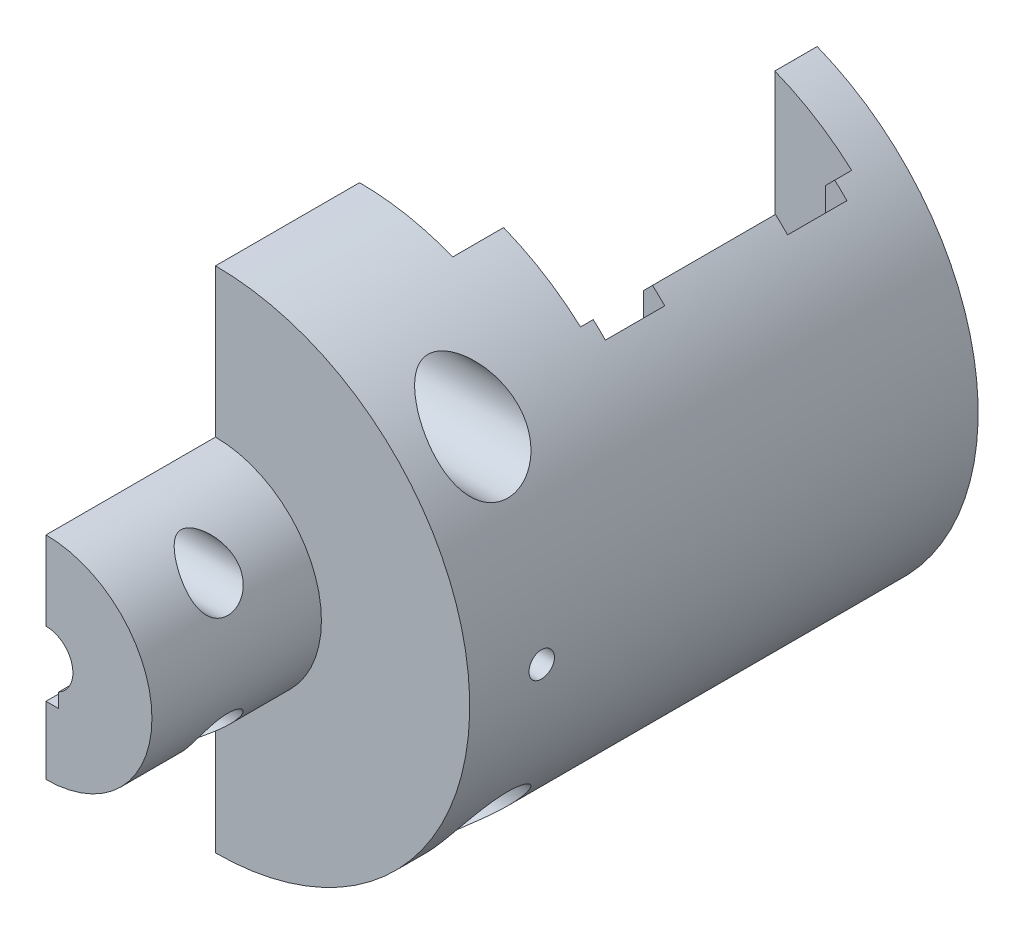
ISO-10303-21;
HEADER;
FILE_DESCRIPTION(('STEP AP214'),'2;1');
FILE_NAME('part.step','',(''),(''),'','','');
FILE_SCHEMA(('AUTOMOTIVE_DESIGN { 1 0 10303 214 1 1 1 1 }'));
ENDSEC;
DATA;
#1=APPLICATION_CONTEXT('core data for automotive mechanical design processes');
#2=APPLICATION_PROTOCOL_DEFINITION('international standard','automotive_design',2000,#1);
#3=PRODUCT_CONTEXT('',#1,'mechanical');
#4=PRODUCT('Part','Part','',(#3));
#5=PRODUCT_RELATED_PRODUCT_CATEGORY('part','',(#4));
#6=PRODUCT_DEFINITION_FORMATION('','',#4);
#7=PRODUCT_DEFINITION_CONTEXT('part definition',#1,'design');
#8=PRODUCT_DEFINITION('design','',#6,#7);
#9=PRODUCT_DEFINITION_SHAPE('','',#8);
#10=(LENGTH_UNIT() NAMED_UNIT(*) SI_UNIT(.MILLI.,.METRE.));
#11=(NAMED_UNIT(*) PLANE_ANGLE_UNIT() SI_UNIT($,.RADIAN.));
#12=(NAMED_UNIT(*) SI_UNIT($,.STERADIAN.) SOLID_ANGLE_UNIT());
#13=UNCERTAINTY_MEASURE_WITH_UNIT(LENGTH_MEASURE(1.E-05),#10,'distance_accuracy_value','');
#14=(GEOMETRIC_REPRESENTATION_CONTEXT(3) GLOBAL_UNCERTAINTY_ASSIGNED_CONTEXT((#13)) GLOBAL_UNIT_ASSIGNED_CONTEXT((#10,
#11,#12)) REPRESENTATION_CONTEXT('',''));
#15=CARTESIAN_POINT('',(0.,0.,0.));
#16=DIRECTION('',(0.,0.,1.));
#17=DIRECTION('',(1.,0.,0.));
#18=AXIS2_PLACEMENT_3D('',#15,#16,#17);
#19=CARTESIAN_POINT('',(186.199999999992,-59.8926546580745,-60.));
#20=DIRECTION('',(1.,0.,0.));
#21=DIRECTION('',(0.,0.,-1.));
#22=AXIS2_PLACEMENT_3D('',#19,#20,#21);
#23=PLANE('',#22);
#24=CARTESIAN_POINT('',(186.199999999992,-81.8926546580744,10.));
#25=DIRECTION('',(1.,0.,0.));
#26=DIRECTION('',(0.,0.,-1.));
#27=AXIS2_PLACEMENT_3D('',#24,#25,#26);
#28=CIRCLE('',#27,1.7);
#29=CARTESIAN_POINT('',(186.199999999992,-81.8926546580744,8.3));
#30=VERTEX_POINT('',#29);
#31=EDGE_CURVE('E368',#30,#30,#28,.T.);
#32=ORIENTED_EDGE('',*,*,#31,.T.);
#33=EDGE_LOOP('',(#32));
#34=FACE_BOUND('',#33,.T.);
#35=CARTESIAN_POINT('',(186.199999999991,-69.8926546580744,-8.5));
#36=DIRECTION('',(1.,0.,0.));
#37=DIRECTION('',(0.,0.,-1.));
#38=AXIS2_PLACEMENT_3D('',#35,#36,#37);
#39=CIRCLE('',#38,2.75);
#40=CARTESIAN_POINT('',(186.199999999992,-69.8926546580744,-11.25));
#41=VERTEX_POINT('',#40);
#42=EDGE_CURVE('E532',#41,#41,#39,.T.);
#43=ORIENTED_EDGE('',*,*,#42,.T.);
#44=EDGE_LOOP('',(#43));
#45=FACE_BOUND('',#44,.T.);
#46=DIRECTION('',(0.,1.,0.));
#47=VECTOR('',#46,1.);
#48=CARTESIAN_POINT('',(186.199999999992,-123.392654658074,-17.));
#49=LINE('',#48,#47);
#50=CARTESIAN_POINT('',(186.199999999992,-86.7176546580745,-17.));
#51=VERTEX_POINT('',#50);
#52=CARTESIAN_POINT('',(186.199999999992,-59.8926546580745,-17.));
#53=VERTEX_POINT('',#52);
#54=EDGE_CURVE('E598',#51,#53,#49,.T.);
#55=ORIENTED_EDGE('',*,*,#54,.F.);
#56=DIRECTION('',(0.,0.,1.));
#57=VECTOR('',#56,1.);
#58=CARTESIAN_POINT('',(186.199999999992,-86.7176546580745,-60.));
#59=LINE('',#58,#57);
#60=CARTESIAN_POINT('',(186.199999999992,-86.7176546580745,20.));
#61=VERTEX_POINT('',#60);
#62=EDGE_CURVE('E264',#51,#61,#59,.T.);
#63=ORIENTED_EDGE('',*,*,#62,.T.);
#64=DIRECTION('',(0.,-1.,0.));
#65=VECTOR('',#64,1.);
#66=CARTESIAN_POINT('',(186.199999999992,-77.3926546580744,20.));
#67=LINE('',#66,#65);
#68=CARTESIAN_POINT('',(186.199999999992,-77.3926546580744,20.));
#69=VERTEX_POINT('',#68);
#70=EDGE_CURVE('E272',#69,#61,#67,.T.);
#71=ORIENTED_EDGE('',*,*,#70,.F.);
#72=DIRECTION('',(0.,0.,-1.));
#73=VECTOR('',#72,1.);
#74=CARTESIAN_POINT('',(186.199999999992,-77.3926546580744,20.));
#75=LINE('',#74,#73);
#76=CARTESIAN_POINT('',(186.199999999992,-77.3926546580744,0.));
#77=VERTEX_POINT('',#76);
#78=EDGE_CURVE('E288',#69,#77,#75,.T.);
#79=ORIENTED_EDGE('',*,*,#78,.T.);
#80=DIRECTION('',(0.,-1.,0.));
#81=VECTOR('',#80,1.);
#82=CARTESIAN_POINT('',(186.199999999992,0.,0.));
#83=LINE('',#82,#81);
#84=CARTESIAN_POINT('',(186.199999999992,-59.8926546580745,0.));
#85=VERTEX_POINT('',#84);
#86=EDGE_CURVE('E293',#85,#77,#83,.T.);
#87=ORIENTED_EDGE('',*,*,#86,.F.);
#88=DIRECTION('',(0.,0.,1.));
#89=VECTOR('',#88,1.);
#90=CARTESIAN_POINT('',(186.199999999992,-59.8926546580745,-60.));
#91=LINE('',#90,#89);
#92=EDGE_CURVE('E601',#53,#85,#91,.T.);
#93=ORIENTED_EDGE('',*,*,#92,.F.);
#94=EDGE_LOOP('',(#55,#63,#71,#79,#87,#93));
#95=FACE_BOUND('',#94,.T.);
#96=ADVANCED_FACE('F16',(#34,#45,#95),#23,.F.);
#97=CARTESIAN_POINT('',(197.199999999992,-123.392654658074,-23.));
#98=DIRECTION('',(1.,0.,0.));
#99=DIRECTION('',(0.,0.,-1.));
#100=AXIS2_PLACEMENT_3D('',#97,#98,#99);
#101=PLANE('',#100);
#102=DIRECTION('',(0.,0.,1.));
#103=VECTOR('',#102,1.);
#104=CARTESIAN_POINT('',(197.199999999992,-61.9820831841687,-60.));
#105=LINE('',#104,#103);
#106=CARTESIAN_POINT('',(197.199999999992,-61.9820831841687,-23.));
#107=VERTEX_POINT('',#106);
#108=CARTESIAN_POINT('',(197.199999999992,-61.9820831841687,-17.));
#109=VERTEX_POINT('',#108);
#110=EDGE_CURVE('E512',#107,#109,#105,.T.);
#111=ORIENTED_EDGE('',*,*,#110,.F.);
#112=DIRECTION('',(0.,1.,0.));
#113=VECTOR('',#112,1.);
#114=CARTESIAN_POINT('',(197.199999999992,-123.392654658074,-23.));
#115=LINE('',#114,#113);
#116=CARTESIAN_POINT('',(197.199999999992,-117.80322613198,-23.));
#117=VERTEX_POINT('',#116);
#118=EDGE_CURVE('E642',#117,#107,#115,.T.);
#119=ORIENTED_EDGE('',*,*,#118,.F.);
#120=DIRECTION('',(0.,0.,1.));
#121=VECTOR('',#120,1.);
#122=CARTESIAN_POINT('',(197.199999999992,-117.80322613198,-60.));
#123=LINE('',#122,#121);
#124=CARTESIAN_POINT('',(197.199999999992,-117.80322613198,-17.));
#125=VERTEX_POINT('',#124);
#126=EDGE_CURVE('E510',#125,#117,#123,.F.);
#127=ORIENTED_EDGE('',*,*,#126,.F.);
#128=DIRECTION('',(0.,1.,0.));
#129=VECTOR('',#128,1.);
#130=CARTESIAN_POINT('',(197.199999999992,-123.392654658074,-17.));
#131=LINE('',#130,#129);
#132=EDGE_CURVE('E641',#125,#109,#131,.T.);
#133=ORIENTED_EDGE('',*,*,#132,.T.);
#134=EDGE_LOOP('',(#111,#119,#127,#133));
#135=FACE_BOUND('',#134,.T.);
#136=ADVANCED_FACE('F583',(#135),#101,.F.);
#137=CARTESIAN_POINT('',(205.199999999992,-123.392654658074,-23.));
#138=DIRECTION('',(0.,0.,-1.));
#139=DIRECTION('',(-1.,0.,0.));
#140=AXIS2_PLACEMENT_3D('',#137,#138,#139);
#141=PLANE('',#140);
#142=ORIENTED_EDGE('',*,*,#118,.T.);
#143=CARTESIAN_POINT('',(186.199999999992,-89.8926546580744,-23.));
#144=DIRECTION('',(0.,0.,-1.));
#145=DIRECTION('',(-1.,0.,0.));
#146=AXIS2_PLACEMENT_3D('',#143,#144,#145);
#147=CIRCLE('',#146,30.);
#148=CARTESIAN_POINT('',(206.276050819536,-67.6002303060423,-23.));
#149=VERTEX_POINT('',#148);
#150=EDGE_CURVE('E619',#107,#149,#147,.T.);
#151=ORIENTED_EDGE('',*,*,#150,.T.);
#152=DIRECTION('',(0.707106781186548,0.707106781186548,0.));
#153=VECTOR('',#152,1.);
#154=CARTESIAN_POINT('',(206.276050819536,-67.6002303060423,-23.));
#155=LINE('',#154,#153);
#156=CARTESIAN_POINT('',(205.199999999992,-68.6762811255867,-23.));
#157=VERTEX_POINT('',#156);
#158=EDGE_CURVE('E436',#149,#157,#155,.F.);
#159=ORIENTED_EDGE('',*,*,#158,.T.);
#160=DIRECTION('',(0.,1.,0.));
#161=VECTOR('',#160,1.);
#162=CARTESIAN_POINT('',(205.199999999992,-123.392654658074,-23.));
#163=LINE('',#162,#161);
#164=CARTESIAN_POINT('',(205.199999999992,-111.109028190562,-23.));
#165=VERTEX_POINT('',#164);
#166=EDGE_CURVE('E507',#165,#157,#163,.T.);
#167=ORIENTED_EDGE('',*,*,#166,.F.);
#168=DIRECTION('',(0.707106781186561,-0.707106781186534,0.));
#169=VECTOR('',#168,1.);
#170=CARTESIAN_POINT('',(206.276050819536,-112.185079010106,-23.));
#171=LINE('',#170,#169);
#172=CARTESIAN_POINT('',(206.276050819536,-112.185079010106,-23.));
#173=VERTEX_POINT('',#172);
#174=EDGE_CURVE('E451',#165,#173,#171,.T.);
#175=ORIENTED_EDGE('',*,*,#174,.T.);
#176=EDGE_CURVE('E613',#173,#117,#147,.T.);
#177=ORIENTED_EDGE('',*,*,#176,.T.);
#178=EDGE_LOOP('',(#142,#151,#159,#167,#175,#177));
#179=FACE_BOUND('',#178,.T.);
#180=ADVANCED_FACE('F589',(#179),#141,.T.);
#181=CARTESIAN_POINT('',(167.199999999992,-123.392654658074,-17.));
#182=DIRECTION('',(0.,0.,1.));
#183=DIRECTION('',(1.,0.,0.));
#184=AXIS2_PLACEMENT_3D('',#181,#182,#183);
#185=PLANE('',#184);
#186=DIRECTION('',(-1.,0.,0.));
#187=VECTOR('',#186,1.);
#188=CARTESIAN_POINT('',(187.699999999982,-94.3926546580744,-17.));
#189=LINE('',#188,#187);
#190=CARTESIAN_POINT('',(187.699999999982,-94.3926546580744,-17.));
#191=VERTEX_POINT('',#190);
#192=CARTESIAN_POINT('',(186.199999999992,-94.3926546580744,-17.));
#193=VERTEX_POINT('',#192);
#194=EDGE_CURVE('E235',#191,#193,#189,.T.);
#195=ORIENTED_EDGE('',*,*,#194,.F.);
#196=DIRECTION('',(0.,-1.,0.));
#197=VECTOR('',#196,1.);
#198=CARTESIAN_POINT('',(187.699999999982,-94.3926546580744,-17.));
#199=LINE('',#198,#197);
#200=CARTESIAN_POINT('',(187.699999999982,-92.6909800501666,-17.));
#201=VERTEX_POINT('',#200);
#202=EDGE_CURVE('E244',#201,#191,#199,.T.);
#203=ORIENTED_EDGE('',*,*,#202,.F.);
#204=CARTESIAN_POINT('',(186.199999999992,-89.8926546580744,-17.));
#205=DIRECTION('',(0.,0.,1.));
#206=DIRECTION('',(1.,0.,0.));
#207=AXIS2_PLACEMENT_3D('',#204,#205,#206);
#208=CIRCLE('',#207,3.175);
#209=EDGE_CURVE('E262',#201,#51,#208,.T.);
#210=ORIENTED_EDGE('',*,*,#209,.T.);
#211=ORIENTED_EDGE('',*,*,#54,.T.);
#212=CARTESIAN_POINT('',(186.199999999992,-89.8926546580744,-17.));
#213=DIRECTION('',(0.,0.,1.));
#214=DIRECTION('',(1.,0.,0.));
#215=AXIS2_PLACEMENT_3D('',#212,#213,#214);
#216=CIRCLE('',#215,30.);
#217=EDGE_CURVE('E622',#109,#53,#216,.T.);
#218=ORIENTED_EDGE('',*,*,#217,.F.);
#219=ORIENTED_EDGE('',*,*,#132,.F.);
#220=CARTESIAN_POINT('',(186.199999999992,-119.892654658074,-17.));
#221=VERTEX_POINT('',#220);
#222=EDGE_CURVE('E618',#221,#125,#216,.T.);
#223=ORIENTED_EDGE('',*,*,#222,.F.);
#224=EDGE_CURVE('E255',#221,#193,#49,.T.);
#225=ORIENTED_EDGE('',*,*,#224,.T.);
#226=EDGE_LOOP('',(#195,#203,#210,#211,#218,#219,#223,#225));
#227=FACE_BOUND('',#226,.T.);
#228=ADVANCED_FACE('F253',(#227),#185,.F.);
#229=CARTESIAN_POINT('',(205.199999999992,-123.392654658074,-24.5));
#230=DIRECTION('',(0.,0.,1.));
#231=DIRECTION('',(1.,0.,0.));
#232=AXIS2_PLACEMENT_3D('',#229,#230,#231);
#233=PLANE('',#232);
#234=DIRECTION('',(0.,1.,0.));
#235=VECTOR('',#234,1.);
#236=CARTESIAN_POINT('',(205.199999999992,-123.392654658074,-24.5));
#237=LINE('',#236,#235);
#238=CARTESIAN_POINT('',(205.199999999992,-111.109028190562,-24.5));
#239=VERTEX_POINT('',#238);
#240=CARTESIAN_POINT('',(205.199999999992,-68.6762811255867,-24.5));
#241=VERTEX_POINT('',#240);
#242=EDGE_CURVE('E502',#239,#241,#237,.T.);
#243=ORIENTED_EDGE('',*,*,#242,.T.);
#244=DIRECTION('',(-0.707106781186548,-0.707106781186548,0.));
#245=VECTOR('',#244,1.);
#246=CARTESIAN_POINT('',(206.276050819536,-67.6002303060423,-24.5));
#247=LINE('',#246,#245);
#248=CARTESIAN_POINT('',(206.276050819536,-67.6002303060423,-24.5));
#249=VERTEX_POINT('',#248);
#250=EDGE_CURVE('E408',#241,#249,#247,.F.);
#251=ORIENTED_EDGE('',*,*,#250,.T.);
#252=CARTESIAN_POINT('',(186.199999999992,-89.8926546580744,-24.5));
#253=DIRECTION('',(0.,0.,1.));
#254=DIRECTION('',(1.,0.,0.));
#255=AXIS2_PLACEMENT_3D('',#252,#253,#254);
#256=CIRCLE('',#255,30.);
#257=CARTESIAN_POINT('',(207.70950649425,-68.979952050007,-24.5));
#258=VERTEX_POINT('',#257);
#259=EDGE_CURVE('E625',#258,#249,#256,.T.);
#260=ORIENTED_EDGE('',*,*,#259,.F.);
#261=DIRECTION('',(0.707106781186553,0.707106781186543,0.));
#262=VECTOR('',#261,1.);
#263=CARTESIAN_POINT('',(179.248401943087,-97.4410566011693,-24.5));
#264=LINE('',#263,#262);
#265=CARTESIAN_POINT('',(206.699999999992,-69.989458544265,-24.5));
#266=VERTEX_POINT('',#265);
#267=EDGE_CURVE('E446',#258,#266,#264,.F.);
#268=ORIENTED_EDGE('',*,*,#267,.T.);
#269=DIRECTION('',(0.,1.,0.));
#270=VECTOR('',#269,1.);
#271=CARTESIAN_POINT('',(206.699999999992,-123.392654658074,-24.5));
#272=LINE('',#271,#270);
#273=CARTESIAN_POINT('',(206.699999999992,-109.795850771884,-24.5));
#274=VERTEX_POINT('',#273);
#275=EDGE_CURVE('E499',#274,#266,#272,.T.);
#276=ORIENTED_EDGE('',*,*,#275,.F.);
#277=DIRECTION('',(0.707106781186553,-0.707106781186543,0.));
#278=VECTOR('',#277,1.);
#279=CARTESIAN_POINT('',(212.748401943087,-115.844252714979,-24.5));
#280=LINE('',#279,#278);
#281=CARTESIAN_POINT('',(207.70950649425,-110.805357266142,-24.5));
#282=VERTEX_POINT('',#281);
#283=EDGE_CURVE('E458',#274,#282,#280,.T.);
#284=ORIENTED_EDGE('',*,*,#283,.T.);
#285=CARTESIAN_POINT('',(206.276050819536,-112.185079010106,-24.5));
#286=VERTEX_POINT('',#285);
#287=EDGE_CURVE('E621',#286,#282,#256,.T.);
#288=ORIENTED_EDGE('',*,*,#287,.F.);
#289=DIRECTION('',(-0.707106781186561,0.707106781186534,0.));
#290=VECTOR('',#289,1.);
#291=CARTESIAN_POINT('',(206.276050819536,-112.185079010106,-24.5));
#292=LINE('',#291,#290);
#293=EDGE_CURVE('E406',#286,#239,#292,.T.);
#294=ORIENTED_EDGE('',*,*,#293,.T.);
#295=EDGE_LOOP('',(#243,#251,#260,#268,#276,#284,#288,#294));
#296=FACE_BOUND('',#295,.T.);
#297=ADVANCED_FACE('F703',(#296),#233,.F.);
#298=CARTESIAN_POINT('',(206.699999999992,-123.392654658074,-24.5));
#299=DIRECTION('',(1.,0.,0.));
#300=DIRECTION('',(0.,0.,-1.));
#301=AXIS2_PLACEMENT_3D('',#298,#299,#300);
#302=PLANE('',#301);
#303=ORIENTED_EDGE('',*,*,#275,.T.);
#304=DIRECTION('',(0.,0.,-1.));
#305=VECTOR('',#304,1.);
#306=CARTESIAN_POINT('',(206.699999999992,-69.989458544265,-31.5));
#307=LINE('',#306,#305);
#308=CARTESIAN_POINT('',(206.699999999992,-69.989458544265,-31.5));
#309=VERTEX_POINT('',#308);
#310=EDGE_CURVE('E434',#266,#309,#307,.T.);
#311=ORIENTED_EDGE('',*,*,#310,.T.);
#312=DIRECTION('',(0.,1.,0.));
#313=VECTOR('',#312,1.);
#314=CARTESIAN_POINT('',(206.699999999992,-123.392654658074,-31.5));
#315=LINE('',#314,#313);
#316=CARTESIAN_POINT('',(206.699999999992,-109.795850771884,-31.5));
#317=VERTEX_POINT('',#316);
#318=EDGE_CURVE('E496',#317,#309,#315,.T.);
#319=ORIENTED_EDGE('',*,*,#318,.F.);
#320=DIRECTION('',(0.,0.,1.));
#321=VECTOR('',#320,1.);
#322=CARTESIAN_POINT('',(206.699999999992,-109.795850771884,-24.5));
#323=LINE('',#322,#321);
#324=EDGE_CURVE('E432',#317,#274,#323,.T.);
#325=ORIENTED_EDGE('',*,*,#324,.T.);
#326=EDGE_LOOP('',(#303,#311,#319,#325));
#327=FACE_BOUND('',#326,.T.);
#328=ADVANCED_FACE('F990',(#327),#302,.F.);
#329=CARTESIAN_POINT('',(205.199999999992,-123.392654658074,-31.5));
#330=DIRECTION('',(0.,0.,-1.));
#331=DIRECTION('',(-1.,0.,0.));
#332=AXIS2_PLACEMENT_3D('',#329,#330,#331);
#333=PLANE('',#332);
#334=CARTESIAN_POINT('',(186.199999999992,-89.8926546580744,-31.5));
#335=DIRECTION('',(0.,0.,-1.));
#336=DIRECTION('',(-1.,0.,0.));
#337=AXIS2_PLACEMENT_3D('',#334,#335,#336);
#338=CIRCLE('',#337,30.);
#339=CARTESIAN_POINT('',(206.276050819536,-67.6002303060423,-31.5));
#340=VERTEX_POINT('',#339);
#341=CARTESIAN_POINT('',(207.70950649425,-68.979952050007,-31.5));
#342=VERTEX_POINT('',#341);
#343=EDGE_CURVE('E628',#340,#342,#338,.T.);
#344=ORIENTED_EDGE('',*,*,#343,.F.);
#345=DIRECTION('',(0.707106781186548,0.707106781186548,0.));
#346=VECTOR('',#345,1.);
#347=CARTESIAN_POINT('',(206.276050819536,-67.6002303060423,-31.5));
#348=LINE('',#347,#346);
#349=CARTESIAN_POINT('',(205.199999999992,-68.6762811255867,-31.5));
#350=VERTEX_POINT('',#349);
#351=EDGE_CURVE('E424',#340,#350,#348,.F.);
#352=ORIENTED_EDGE('',*,*,#351,.T.);
#353=DIRECTION('',(0.,1.,0.));
#354=VECTOR('',#353,1.);
#355=CARTESIAN_POINT('',(205.199999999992,-123.392654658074,-31.5));
#356=LINE('',#355,#354);
#357=CARTESIAN_POINT('',(205.199999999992,-111.109028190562,-31.5));
#358=VERTEX_POINT('',#357);
#359=EDGE_CURVE('E493',#358,#350,#356,.T.);
#360=ORIENTED_EDGE('',*,*,#359,.F.);
#361=DIRECTION('',(0.707106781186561,-0.707106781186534,0.));
#362=VECTOR('',#361,1.);
#363=CARTESIAN_POINT('',(206.276050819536,-112.185079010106,-31.5));
#364=LINE('',#363,#362);
#365=CARTESIAN_POINT('',(206.276050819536,-112.185079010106,-31.5));
#366=VERTEX_POINT('',#365);
#367=EDGE_CURVE('E422',#358,#366,#364,.T.);
#368=ORIENTED_EDGE('',*,*,#367,.T.);
#369=CARTESIAN_POINT('',(207.70950649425,-110.805357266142,-31.5));
#370=VERTEX_POINT('',#369);
#371=EDGE_CURVE('E624',#370,#366,#338,.T.);
#372=ORIENTED_EDGE('',*,*,#371,.F.);
#373=DIRECTION('',(-0.707106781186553,0.707106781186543,0.));
#374=VECTOR('',#373,1.);
#375=CARTESIAN_POINT('',(212.748401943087,-115.844252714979,-31.5));
#376=LINE('',#375,#374);
#377=EDGE_CURVE('E456',#370,#317,#376,.T.);
#378=ORIENTED_EDGE('',*,*,#377,.T.);
#379=ORIENTED_EDGE('',*,*,#318,.T.);
#380=DIRECTION('',(-0.707106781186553,-0.707106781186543,0.));
#381=VECTOR('',#380,1.);
#382=CARTESIAN_POINT('',(179.248401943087,-97.4410566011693,-31.5));
#383=LINE('',#382,#381);
#384=EDGE_CURVE('E448',#309,#342,#383,.F.);
#385=ORIENTED_EDGE('',*,*,#384,.T.);
#386=EDGE_LOOP('',(#344,#352,#360,#368,#372,#378,#379,#385));
#387=FACE_BOUND('',#386,.T.);
#388=ADVANCED_FACE('F681',(#387),#333,.F.);
#389=CARTESIAN_POINT('',(205.199999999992,-123.392654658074,-60.));
#390=DIRECTION('',(1.,0.,0.));
#391=DIRECTION('',(0.,0.,-1.));
#392=AXIS2_PLACEMENT_3D('',#389,#390,#391);
#393=PLANE('',#392);
#394=ORIENTED_EDGE('',*,*,#166,.T.);
#395=DIRECTION('',(0.,0.,-1.));
#396=VECTOR('',#395,1.);
#397=CARTESIAN_POINT('',(205.199999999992,-68.6762811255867,-24.5));
#398=LINE('',#397,#396);
#399=EDGE_CURVE('E404',#157,#241,#398,.T.);
#400=ORIENTED_EDGE('',*,*,#399,.T.);
#401=ORIENTED_EDGE('',*,*,#242,.F.);
#402=DIRECTION('',(0.,0.,1.));
#403=VECTOR('',#402,1.);
#404=CARTESIAN_POINT('',(205.199999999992,-111.109028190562,-23.));
#405=LINE('',#404,#403);
#406=EDGE_CURVE('E402',#239,#165,#405,.T.);
#407=ORIENTED_EDGE('',*,*,#406,.T.);
#408=EDGE_LOOP('',(#394,#400,#401,#407));
#409=FACE_BOUND('',#408,.T.);
#410=ADVANCED_FACE('F700',(#409),#393,.F.);
#411=CARTESIAN_POINT('',(205.199999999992,-123.392654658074,-46.));
#412=DIRECTION('',(0.,0.,1.));
#413=DIRECTION('',(1.,0.,0.));
#414=AXIS2_PLACEMENT_3D('',#411,#412,#413);
#415=PLANE('',#414);
#416=DIRECTION('',(0.,1.,0.));
#417=VECTOR('',#416,1.);
#418=CARTESIAN_POINT('',(205.199999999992,-123.392654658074,-46.));
#419=LINE('',#418,#417);
#420=CARTESIAN_POINT('',(205.199999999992,-111.109028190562,-46.));
#421=VERTEX_POINT('',#420);
#422=CARTESIAN_POINT('',(205.199999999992,-68.6762811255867,-46.));
#423=VERTEX_POINT('',#422);
#424=EDGE_CURVE('E487',#421,#423,#419,.T.);
#425=ORIENTED_EDGE('',*,*,#424,.T.);
#426=DIRECTION('',(-0.707106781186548,-0.707106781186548,0.));
#427=VECTOR('',#426,1.);
#428=CARTESIAN_POINT('',(206.276050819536,-67.6002303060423,-46.));
#429=LINE('',#428,#427);
#430=CARTESIAN_POINT('',(206.276050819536,-67.6002303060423,-46.));
#431=VERTEX_POINT('',#430);
#432=EDGE_CURVE('E430',#423,#431,#429,.F.);
#433=ORIENTED_EDGE('',*,*,#432,.T.);
#434=CARTESIAN_POINT('',(186.199999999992,-89.8926546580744,-46.));
#435=DIRECTION('',(0.,0.,1.));
#436=DIRECTION('',(1.,0.,0.));
#437=AXIS2_PLACEMENT_3D('',#434,#435,#436);
#438=CIRCLE('',#437,30.);
#439=CARTESIAN_POINT('',(207.70950649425,-68.979952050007,-46.));
#440=VERTEX_POINT('',#439);
#441=EDGE_CURVE('E630',#440,#431,#438,.T.);
#442=ORIENTED_EDGE('',*,*,#441,.F.);
#443=DIRECTION('',(0.707106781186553,0.707106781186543,0.));
#444=VECTOR('',#443,1.);
#445=CARTESIAN_POINT('',(179.248401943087,-97.4410566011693,-46.));
#446=LINE('',#445,#444);
#447=CARTESIAN_POINT('',(206.699999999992,-69.989458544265,-46.));
#448=VERTEX_POINT('',#447);
#449=EDGE_CURVE('E441',#440,#448,#446,.F.);
#450=ORIENTED_EDGE('',*,*,#449,.T.);
#451=DIRECTION('',(0.,1.,0.));
#452=VECTOR('',#451,1.);
#453=CARTESIAN_POINT('',(206.699999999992,-123.392654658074,-46.));
#454=LINE('',#453,#452);
#455=CARTESIAN_POINT('',(206.699999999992,-109.795850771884,-46.));
#456=VERTEX_POINT('',#455);
#457=EDGE_CURVE('E480',#456,#448,#454,.T.);
#458=ORIENTED_EDGE('',*,*,#457,.F.);
#459=DIRECTION('',(0.707106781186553,-0.707106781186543,0.));
#460=VECTOR('',#459,1.);
#461=CARTESIAN_POINT('',(212.748401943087,-115.844252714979,-46.));
#462=LINE('',#461,#460);
#463=CARTESIAN_POINT('',(207.70950649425,-110.805357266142,-46.));
#464=VERTEX_POINT('',#463);
#465=EDGE_CURVE('E11',#456,#464,#462,.T.);
#466=ORIENTED_EDGE('',*,*,#465,.T.);
#467=CARTESIAN_POINT('',(206.276050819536,-112.185079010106,-46.));
#468=VERTEX_POINT('',#467);
#469=EDGE_CURVE('E485',#468,#464,#438,.T.);
#470=ORIENTED_EDGE('',*,*,#469,.F.);
#471=DIRECTION('',(-0.707106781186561,0.707106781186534,0.));
#472=VECTOR('',#471,1.);
#473=CARTESIAN_POINT('',(206.276050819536,-112.185079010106,-46.));
#474=LINE('',#473,#472);
#475=EDGE_CURVE('E44',#468,#421,#474,.T.);
#476=ORIENTED_EDGE('',*,*,#475,.T.);
#477=EDGE_LOOP('',(#425,#433,#442,#450,#458,#466,#470,#476));
#478=FACE_BOUND('',#477,.T.);
#479=ADVANCED_FACE('F484',(#478),#415,.F.);
#480=CARTESIAN_POINT('',(206.699999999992,-123.392654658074,-46.));
#481=DIRECTION('',(1.,0.,0.));
#482=DIRECTION('',(0.,0.,-1.));
#483=AXIS2_PLACEMENT_3D('',#480,#481,#482);
#484=PLANE('',#483);
#485=ORIENTED_EDGE('',*,*,#457,.T.);
#486=DIRECTION('',(0.,0.,-1.));
#487=VECTOR('',#486,1.);
#488=CARTESIAN_POINT('',(206.699999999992,-69.989458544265,-53.));
#489=LINE('',#488,#487);
#490=CARTESIAN_POINT('',(206.699999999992,-69.989458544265,-53.));
#491=VERTEX_POINT('',#490);
#492=EDGE_CURVE('E420',#448,#491,#489,.T.);
#493=ORIENTED_EDGE('',*,*,#492,.T.);
#494=DIRECTION('',(0.,1.,0.));
#495=VECTOR('',#494,1.);
#496=CARTESIAN_POINT('',(206.699999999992,-123.392654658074,-53.));
#497=LINE('',#496,#495);
#498=CARTESIAN_POINT('',(206.699999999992,-109.795850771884,-53.));
#499=VERTEX_POINT('',#498);
#500=EDGE_CURVE('E467',#499,#491,#497,.T.);
#501=ORIENTED_EDGE('',*,*,#500,.F.);
#502=DIRECTION('',(0.,0.,1.));
#503=VECTOR('',#502,1.);
#504=CARTESIAN_POINT('',(206.699999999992,-109.795850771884,-46.));
#505=LINE('',#504,#503);
#506=EDGE_CURVE('E418',#499,#456,#505,.T.);
#507=ORIENTED_EDGE('',*,*,#506,.T.);
#508=EDGE_LOOP('',(#485,#493,#501,#507));
#509=FACE_BOUND('',#508,.T.);
#510=ADVANCED_FACE('F476',(#509),#484,.F.);
#511=CARTESIAN_POINT('',(205.199999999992,-123.392654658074,-53.));
#512=DIRECTION('',(0.,0.,-1.));
#513=DIRECTION('',(-1.,0.,0.));
#514=AXIS2_PLACEMENT_3D('',#511,#512,#513);
#515=PLANE('',#514);
#516=CARTESIAN_POINT('',(186.199999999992,-89.8926546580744,-53.));
#517=DIRECTION('',(0.,0.,-1.));
#518=DIRECTION('',(-1.,0.,0.));
#519=AXIS2_PLACEMENT_3D('',#516,#517,#518);
#520=CIRCLE('',#519,30.);
#521=CARTESIAN_POINT('',(206.276050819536,-67.6002303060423,-53.));
#522=VERTEX_POINT('',#521);
#523=CARTESIAN_POINT('',(207.70950649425,-68.979952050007,-53.));
#524=VERTEX_POINT('',#523);
#525=EDGE_CURVE('E633',#522,#524,#520,.T.);
#526=ORIENTED_EDGE('',*,*,#525,.F.);
#527=DIRECTION('',(0.707106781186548,0.707106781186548,0.));
#528=VECTOR('',#527,1.);
#529=CARTESIAN_POINT('',(206.276050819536,-67.6002303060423,-53.));
#530=LINE('',#529,#528);
#531=CARTESIAN_POINT('',(205.199999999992,-68.6762811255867,-53.));
#532=VERTEX_POINT('',#531);
#533=EDGE_CURVE('E412',#522,#532,#530,.F.);
#534=ORIENTED_EDGE('',*,*,#533,.T.);
#535=DIRECTION('',(0.,1.,0.));
#536=VECTOR('',#535,1.);
#537=CARTESIAN_POINT('',(205.199999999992,-123.392654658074,-53.));
#538=LINE('',#537,#536);
#539=CARTESIAN_POINT('',(205.199999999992,-111.109028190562,-53.));
#540=VERTEX_POINT('',#539);
#541=EDGE_CURVE('E479',#540,#532,#538,.T.);
#542=ORIENTED_EDGE('',*,*,#541,.F.);
#543=DIRECTION('',(0.707106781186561,-0.707106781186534,0.));
#544=VECTOR('',#543,1.);
#545=CARTESIAN_POINT('',(206.276050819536,-112.185079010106,-53.));
#546=LINE('',#545,#544);
#547=CARTESIAN_POINT('',(206.276050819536,-112.185079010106,-53.));
#548=VERTEX_POINT('',#547);
#549=EDGE_CURVE('E410',#540,#548,#546,.T.);
#550=ORIENTED_EDGE('',*,*,#549,.T.);
#551=CARTESIAN_POINT('',(207.70950649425,-110.805357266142,-53.));
#552=VERTEX_POINT('',#551);
#553=EDGE_CURVE('E470',#552,#548,#520,.T.);
#554=ORIENTED_EDGE('',*,*,#553,.F.);
#555=DIRECTION('',(-0.707106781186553,0.707106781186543,0.));
#556=VECTOR('',#555,1.);
#557=CARTESIAN_POINT('',(212.748401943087,-115.844252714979,-53.));
#558=LINE('',#557,#556);
#559=EDGE_CURVE('E30',#552,#499,#558,.T.);
#560=ORIENTED_EDGE('',*,*,#559,.T.);
#561=ORIENTED_EDGE('',*,*,#500,.T.);
#562=DIRECTION('',(-0.707106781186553,-0.707106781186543,0.));
#563=VECTOR('',#562,1.);
#564=CARTESIAN_POINT('',(179.248401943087,-97.4410566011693,-53.));
#565=LINE('',#564,#563);
#566=EDGE_CURVE('E443',#491,#524,#565,.F.);
#567=ORIENTED_EDGE('',*,*,#566,.T.);
#568=EDGE_LOOP('',(#526,#534,#542,#550,#554,#560,#561,#567));
#569=FACE_BOUND('',#568,.T.);
#570=ADVANCED_FACE('F466',(#569),#515,.F.);
#571=ORIENTED_EDGE('',*,*,#359,.T.);
#572=DIRECTION('',(0.,0.,-1.));
#573=VECTOR('',#572,1.);
#574=CARTESIAN_POINT('',(205.199999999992,-68.6762811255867,-46.));
#575=LINE('',#574,#573);
#576=EDGE_CURVE('E37',#350,#423,#575,.T.);
#577=ORIENTED_EDGE('',*,*,#576,.T.);
#578=ORIENTED_EDGE('',*,*,#424,.F.);
#579=DIRECTION('',(0.,0.,1.));
#580=VECTOR('',#579,1.);
#581=CARTESIAN_POINT('',(205.199999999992,-111.109028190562,-31.5));
#582=LINE('',#581,#580);
#583=EDGE_CURVE('E426',#421,#358,#582,.T.);
#584=ORIENTED_EDGE('',*,*,#583,.T.);
#585=EDGE_LOOP('',(#571,#577,#578,#584));
#586=FACE_BOUND('',#585,.T.);
#587=ADVANCED_FACE('F678',(#586),#393,.F.);
#588=CARTESIAN_POINT('',(197.199999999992,-123.392654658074,-60.));
#589=DIRECTION('',(1.,0.,0.));
#590=DIRECTION('',(0.,0.,-1.));
#591=AXIS2_PLACEMENT_3D('',#588,#589,#590);
#592=PLANE('',#591);
#593=DIRECTION('',(0.,0.,1.));
#594=VECTOR('',#593,1.);
#595=CARTESIAN_POINT('',(197.199999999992,-61.9820831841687,-60.));
#596=LINE('',#595,#594);
#597=CARTESIAN_POINT('',(197.199999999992,-61.9820831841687,-60.));
#598=VERTEX_POINT('',#597);
#599=CARTESIAN_POINT('',(197.199999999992,-61.9820831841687,-55.));
#600=VERTEX_POINT('',#599);
#601=EDGE_CURVE('E639',#598,#600,#596,.T.);
#602=ORIENTED_EDGE('',*,*,#601,.F.);
#603=DIRECTION('',(0.,1.,0.));
#604=VECTOR('',#603,1.);
#605=CARTESIAN_POINT('',(197.199999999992,-123.392654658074,-60.));
#606=LINE('',#605,#604);
#607=CARTESIAN_POINT('',(197.199999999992,-117.80322613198,-60.));
#608=VERTEX_POINT('',#607);
#609=EDGE_CURVE('E489',#608,#598,#606,.T.);
#610=ORIENTED_EDGE('',*,*,#609,.F.);
#611=DIRECTION('',(0.,0.,1.));
#612=VECTOR('',#611,1.);
#613=CARTESIAN_POINT('',(197.199999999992,-117.80322613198,-60.));
#614=LINE('',#613,#612);
#615=CARTESIAN_POINT('',(197.199999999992,-117.80322613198,-55.));
#616=VERTEX_POINT('',#615);
#617=EDGE_CURVE('E635',#616,#608,#614,.F.);
#618=ORIENTED_EDGE('',*,*,#617,.F.);
#619=DIRECTION('',(0.,1.,0.));
#620=VECTOR('',#619,1.);
#621=CARTESIAN_POINT('',(197.199999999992,-123.392654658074,-55.));
#622=LINE('',#621,#620);
#623=EDGE_CURVE('E645',#616,#600,#622,.T.);
#624=ORIENTED_EDGE('',*,*,#623,.T.);
#625=EDGE_LOOP('',(#602,#610,#618,#624));
#626=FACE_BOUND('',#625,.T.);
#627=ADVANCED_FACE('F966',(#626),#592,.F.);
#628=CARTESIAN_POINT('',(205.199999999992,-123.392654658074,-55.));
#629=DIRECTION('',(0.,0.,1.));
#630=DIRECTION('',(1.,0.,0.));
#631=AXIS2_PLACEMENT_3D('',#628,#629,#630);
#632=PLANE('',#631);
#633=CARTESIAN_POINT('',(186.199999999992,-89.8926546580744,-55.));
#634=DIRECTION('',(0.,0.,1.));
#635=DIRECTION('',(1.,0.,0.));
#636=AXIS2_PLACEMENT_3D('',#633,#634,#635);
#637=CIRCLE('',#636,30.);
#638=CARTESIAN_POINT('',(206.276050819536,-112.185079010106,-55.));
#639=VERTEX_POINT('',#638);
#640=EDGE_CURVE('E632',#616,#639,#637,.T.);
#641=ORIENTED_EDGE('',*,*,#640,.T.);
#642=DIRECTION('',(-0.707106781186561,0.707106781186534,0.));
#643=VECTOR('',#642,1.);
#644=CARTESIAN_POINT('',(206.276050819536,-112.185079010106,-55.));
#645=LINE('',#644,#643);
#646=CARTESIAN_POINT('',(205.199999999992,-111.109028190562,-55.));
#647=VERTEX_POINT('',#646);
#648=EDGE_CURVE('E454',#639,#647,#645,.T.);
#649=ORIENTED_EDGE('',*,*,#648,.T.);
#650=DIRECTION('',(0.,1.,0.));
#651=VECTOR('',#650,1.);
#652=CARTESIAN_POINT('',(205.199999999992,-123.392654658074,-55.));
#653=LINE('',#652,#651);
#654=CARTESIAN_POINT('',(205.199999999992,-68.6762811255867,-55.));
#655=VERTEX_POINT('',#654);
#656=EDGE_CURVE('E495',#647,#655,#653,.T.);
#657=ORIENTED_EDGE('',*,*,#656,.T.);
#658=DIRECTION('',(-0.707106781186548,-0.707106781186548,0.));
#659=VECTOR('',#658,1.);
#660=CARTESIAN_POINT('',(206.276050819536,-67.6002303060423,-55.));
#661=LINE('',#660,#659);
#662=CARTESIAN_POINT('',(206.276050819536,-67.6002303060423,-55.));
#663=VERTEX_POINT('',#662);
#664=EDGE_CURVE('E438',#655,#663,#661,.F.);
#665=ORIENTED_EDGE('',*,*,#664,.T.);
#666=EDGE_CURVE('E636',#663,#600,#637,.T.);
#667=ORIENTED_EDGE('',*,*,#666,.T.);
#668=ORIENTED_EDGE('',*,*,#623,.F.);
#669=EDGE_LOOP('',(#641,#649,#657,#665,#667,#668));
#670=FACE_BOUND('',#669,.T.);
#671=ADVANCED_FACE('F665',(#670),#632,.T.);
#672=CARTESIAN_POINT('',(0.,0.,-60.));
#673=DIRECTION('',(0.,0.,-1.));
#674=DIRECTION('',(-1.,0.,0.));
#675=AXIS2_PLACEMENT_3D('',#672,#673,#674);
#676=PLANE('',#675);
#677=ORIENTED_EDGE('',*,*,#609,.T.);
#678=CARTESIAN_POINT('',(186.199999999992,-89.8926546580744,-60.));
#679=DIRECTION('',(0.,0.,1.));
#680=DIRECTION('',(1.,0.,0.));
#681=AXIS2_PLACEMENT_3D('',#678,#679,#680);
#682=CIRCLE('',#681,30.);
#683=EDGE_CURVE('E611',#608,#598,#682,.T.);
#684=ORIENTED_EDGE('',*,*,#683,.F.);
#685=EDGE_LOOP('',(#677,#684));
#686=FACE_BOUND('',#685,.T.);
#687=ADVANCED_FACE('F956',(#686),#676,.T.);
#688=ORIENTED_EDGE('',*,*,#541,.T.);
#689=DIRECTION('',(0.,0.,-1.));
#690=VECTOR('',#689,1.);
#691=CARTESIAN_POINT('',(205.199999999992,-68.6762811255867,-55.));
#692=LINE('',#691,#690);
#693=EDGE_CURVE('E416',#532,#655,#692,.T.);
#694=ORIENTED_EDGE('',*,*,#693,.T.);
#695=ORIENTED_EDGE('',*,*,#656,.F.);
#696=DIRECTION('',(0.,0.,1.));
#697=VECTOR('',#696,1.);
#698=CARTESIAN_POINT('',(205.199999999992,-111.109028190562,-53.));
#699=LINE('',#698,#697);
#700=EDGE_CURVE('E414',#647,#540,#699,.T.);
#701=ORIENTED_EDGE('',*,*,#700,.T.);
#702=EDGE_LOOP('',(#688,#694,#695,#701));
#703=FACE_BOUND('',#702,.T.);
#704=ADVANCED_FACE('F655',(#703),#393,.F.);
#705=CARTESIAN_POINT('',(186.199999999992,-89.8926546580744,-60.));
#706=DIRECTION('',(0.,0.,1.));
#707=DIRECTION('',(1.,0.,0.));
#708=AXIS2_PLACEMENT_3D('',#705,#706,#707);
#709=CYLINDRICAL_SURFACE('',#708,30.);
#710=CARTESIAN_POINT('',(216.199999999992,-89.8926546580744,-9.99999999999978));
#711=CARTESIAN_POINT('',(216.199999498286,-89.8084554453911,-9.99999628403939));
#712=CARTESIAN_POINT('',(216.199641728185,-89.7241965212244,-9.99288668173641));
#713=CARTESIAN_POINT('',(216.198248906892,-89.5580030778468,-9.96462589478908));
#714=CARTESIAN_POINT('',(216.197213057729,-89.4760714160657,-9.94345816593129));
#715=CARTESIAN_POINT('',(216.194581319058,-89.3169640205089,-9.88768869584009));
#716=CARTESIAN_POINT('',(216.192985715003,-89.2397858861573,-9.85309380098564));
#717=CARTESIAN_POINT('',(216.189414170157,-89.0923530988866,-9.77146254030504));
#718=CARTESIAN_POINT('',(216.187438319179,-89.0220968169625,-9.72442911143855));
#719=CARTESIAN_POINT('',(216.183326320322,-88.8904101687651,-9.61920299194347));
#720=CARTESIAN_POINT('',(216.18119003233,-88.8289876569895,-9.56100047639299));
#721=CARTESIAN_POINT('',(216.17699914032,-88.7167790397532,-9.43510795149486));
#722=CARTESIAN_POINT('',(216.174944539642,-88.6659933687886,-9.36741755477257));
#723=CARTESIAN_POINT('',(216.171147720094,-88.5764783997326,-9.2244295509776));
#724=CARTESIAN_POINT('',(216.169405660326,-88.5377552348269,-9.14912809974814));
#725=CARTESIAN_POINT('',(216.166432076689,-88.4735038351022,-8.99308257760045));
#726=CARTESIAN_POINT('',(216.165200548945,-88.4479755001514,-8.91233854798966));
#727=CARTESIAN_POINT('',(216.163388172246,-88.4108591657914,-8.74777214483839));
#728=CARTESIAN_POINT('',(216.162806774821,-88.3992594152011,-8.66395242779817));
#729=CARTESIAN_POINT('',(216.162358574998,-88.390293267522,-8.4955536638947));
#730=CARTESIAN_POINT('',(216.16249176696,-88.3929267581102,-8.410974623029));
#731=CARTESIAN_POINT('',(216.163457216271,-88.412342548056,-8.24353797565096));
#732=CARTESIAN_POINT('',(216.164288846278,-88.4291121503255,-8.16067889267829));
#733=CARTESIAN_POINT('',(216.166556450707,-88.4763044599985,-7.99895332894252));
#734=CARTESIAN_POINT('',(216.167992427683,-88.5067272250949,-7.92008686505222));
#735=CARTESIAN_POINT('',(216.171307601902,-88.5803767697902,-7.76854436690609));
#736=CARTESIAN_POINT('',(216.173186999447,-88.6236093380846,-7.69587115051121));
#737=CARTESIAN_POINT('',(216.177176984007,-88.7216470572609,-7.55880889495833));
#738=CARTESIAN_POINT('',(216.179287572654,-88.7764522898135,-7.49441991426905));
#739=CARTESIAN_POINT('',(216.183504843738,-88.8961512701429,-7.37567999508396));
#740=CARTESIAN_POINT('',(216.185611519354,-88.9610560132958,-7.32134013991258));
#741=CARTESIAN_POINT('',(216.189581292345,-89.0990729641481,-7.22432638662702));
#742=CARTESIAN_POINT('',(216.191444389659,-89.1721851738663,-7.18165249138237));
#743=CARTESIAN_POINT('',(216.194717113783,-89.324548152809,-7.1091830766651));
#744=CARTESIAN_POINT('',(216.196126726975,-89.4037991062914,-7.07938794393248));
#745=CARTESIAN_POINT('',(216.198333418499,-89.5661870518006,-7.03352907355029));
#746=CARTESIAN_POINT('',(216.199130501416,-89.6493240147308,-7.01746523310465));
#747=CARTESIAN_POINT('',(216.200021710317,-89.817027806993,-6.99953860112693));
#748=CARTESIAN_POINT('',(216.200116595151,-89.9015929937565,-6.99766047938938));
#749=CARTESIAN_POINT('',(216.199594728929,-90.0698373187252,-7.00811859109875));
#750=CARTESIAN_POINT('',(216.198977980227,-90.15351645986,-7.0204547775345));
#751=CARTESIAN_POINT('',(216.197102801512,-90.3175703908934,-7.05897863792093));
#752=CARTESIAN_POINT('',(216.195844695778,-90.3979468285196,-7.08515931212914));
#753=CARTESIAN_POINT('',(216.192828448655,-90.5531645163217,-7.15062187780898));
#754=CARTESIAN_POINT('',(216.191070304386,-90.6280057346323,-7.18990384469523));
#755=CARTESIAN_POINT('',(216.18724987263,-90.7700989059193,-7.28049317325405));
#756=CARTESIAN_POINT('',(216.185187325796,-90.8373443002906,-7.33181081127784));
#757=CARTESIAN_POINT('',(216.180991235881,-90.9622710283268,-7.44499974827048));
#758=CARTESIAN_POINT('',(216.178857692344,-91.019952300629,-7.50687111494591));
#759=CARTESIAN_POINT('',(216.174757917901,-91.1241650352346,-7.63947715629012));
#760=CARTESIAN_POINT('',(216.172791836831,-91.1706865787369,-7.71021963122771));
#761=CARTESIAN_POINT('',(216.169251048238,-91.2511914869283,-7.85852035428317));
#762=CARTESIAN_POINT('',(216.167676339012,-91.2851749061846,-7.9360785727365));
#763=CARTESIAN_POINT('',(216.165096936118,-91.3396216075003,-8.09577244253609));
#764=CARTESIAN_POINT('',(216.164091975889,-91.3600912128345,-8.17790593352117));
#765=CARTESIAN_POINT('',(216.162764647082,-91.3869499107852,-8.34444911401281));
#766=CARTESIAN_POINT('',(216.16244227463,-91.3933390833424,-8.42885879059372));
#767=CARTESIAN_POINT('',(216.162516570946,-91.3918547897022,-8.59745952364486));
#768=CARTESIAN_POINT('',(216.162912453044,-91.3839969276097,-8.68165071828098));
#769=CARTESIAN_POINT('',(216.164376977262,-91.3542738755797,-8.84751698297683));
#770=CARTESIAN_POINT('',(216.165445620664,-91.3324086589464,-8.92919204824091));
#771=CARTESIAN_POINT('',(216.168135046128,-91.2752947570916,-9.08771086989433));
#772=CARTESIAN_POINT('',(216.169755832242,-91.2400459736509,-9.16455459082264));
#773=CARTESIAN_POINT('',(216.173366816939,-91.1571682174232,-9.31123432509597));
#774=CARTESIAN_POINT('',(216.175357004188,-91.1095396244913,-9.38107055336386));
#775=CARTESIAN_POINT('',(216.179484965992,-91.0031983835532,-9.51183084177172));
#776=CARTESIAN_POINT('',(216.181622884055,-90.9444748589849,-9.57274605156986));
#777=CARTESIAN_POINT('',(216.185804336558,-90.8176178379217,-9.68387253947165));
#778=CARTESIAN_POINT('',(216.187847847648,-90.7494820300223,-9.73408118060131));
#779=CARTESIAN_POINT('',(216.191611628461,-90.6056810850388,-9.8223927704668));
#780=CARTESIAN_POINT('',(216.193331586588,-90.5300087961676,-9.86048407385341));
#781=CARTESIAN_POINT('',(216.196249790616,-90.3733909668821,-9.92337543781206));
#782=CARTESIAN_POINT('',(216.197448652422,-90.2924517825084,-9.94819119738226));
#783=CARTESIAN_POINT('',(216.198872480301,-90.1579505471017,-9.97731782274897));
#784=CARTESIAN_POINT('',(216.199293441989,-90.1052596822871,-9.9858127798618));
#785=CARTESIAN_POINT('',(216.199857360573,-89.9992720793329,-9.99715504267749));
#786=CARTESIAN_POINT('',(216.200000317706,-89.9459753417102,-10.0000023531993));
#787=CARTESIAN_POINT('',(216.199999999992,-89.8926546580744,-9.99999999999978));
#788=B_SPLINE_CURVE_WITH_KNOTS('',3,(#710,#711,#712,#713,#714,#715,#716,#717,#718,#719,#720,
#721,#722,#723,#724,#725,#726,#727,#728,#729,#730,#731,#732,#733,#734,#735,#736,#737,#738,#739,
#740,#741,#742,#743,#744,#745,#746,#747,#748,#749,#750,#751,#752,#753,#754,#755,#756,#757,#758,
#759,#760,#761,#762,#763,#764,#765,#766,#767,#768,#769,#770,#771,#772,#773,#774,#775,#776,#777,
#778,#779,#780,#781,#782,#783,#784,#785,#786,#787),.UNSPECIFIED.,.T.,.F.,(4,2,2,2,2,2,2,2,2,2,2,
2,2,2,2,2,2,2,2,2,2,2,2,2,2,2,2,2,2,2,2,2,2,2,2,2,2,2,4),(0.,0.25240299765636,0.505103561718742,
0.757675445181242,1.01018774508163,1.26292319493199,1.51566896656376,1.76854303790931,
2.02141519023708,2.27407385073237,2.52673051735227,2.77916048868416,3.03159152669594,
3.28413681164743,3.53668387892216,3.78950784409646,4.04233187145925,4.2951634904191,
4.54799321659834,4.80054967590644,5.05310529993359,5.30553335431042,5.557962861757,
5.81060868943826,6.06325613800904,6.31612731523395,6.5689973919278,6.82174906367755,
7.07449930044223,7.32697287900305,7.57944693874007,7.83192285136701,8.08439101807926,
8.33710798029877,8.58988711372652,8.84290845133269,9.09562991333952,9.25546884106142,
9.41530763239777),.UNSPECIFIED.);
#789=CARTESIAN_POINT('',(216.199999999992,-89.8926546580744,-9.99999999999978));
#790=VERTEX_POINT('',#789);
#791=EDGE_CURVE('E20',#790,#790,#788,.T.);
#792=ORIENTED_EDGE('',*,*,#791,.F.);
#793=EDGE_LOOP('',(#792));
#794=FACE_BOUND('',#793,.T.);
#795=CARTESIAN_POINT('',(208.56067977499,-69.8926546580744,-13.4999999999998));
#796=CARTESIAN_POINT('',(208.386087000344,-69.6974545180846,-13.5000011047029));
#797=CARTESIAN_POINT('',(208.208929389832,-69.504542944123,-13.4885781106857));
#798=CARTESIAN_POINT('',(207.850812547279,-69.1246376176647,-13.4443653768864));
#799=CARTESIAN_POINT('',(207.669851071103,-68.9376475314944,-13.4115626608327));
#800=CARTESIAN_POINT('',(207.304806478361,-68.5700254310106,-13.3256018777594));
#801=CARTESIAN_POINT('',(207.120713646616,-68.3894224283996,-13.2723614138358));
#802=CARTESIAN_POINT('',(206.751528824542,-68.0363077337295,-13.1464085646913));
#803=CARTESIAN_POINT('',(206.566437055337,-67.8637943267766,-13.0737003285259));
#804=CARTESIAN_POINT('',(206.194608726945,-67.5257270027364,-12.9083402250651));
#805=CARTESIAN_POINT('',(206.007876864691,-67.3602722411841,-12.8154748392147));
#806=CARTESIAN_POINT('',(205.636531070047,-67.0391753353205,-12.6102294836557));
#807=CARTESIAN_POINT('',(205.451917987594,-66.8835370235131,-12.4978419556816));
#808=CARTESIAN_POINT('',(205.087818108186,-66.5837355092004,-12.2534425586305));
#809=CARTESIAN_POINT('',(204.908314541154,-66.4395310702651,-12.1215066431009));
#810=CARTESIAN_POINT('',(204.55691193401,-66.1634829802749,-11.8365559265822));
#811=CARTESIAN_POINT('',(204.385005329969,-66.0316268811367,-11.6835627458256));
#812=CARTESIAN_POINT('',(204.065811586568,-65.7918345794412,-11.3669930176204));
#813=CARTESIAN_POINT('',(203.917646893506,-65.6828406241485,-11.2051172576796));
#814=CARTESIAN_POINT('',(203.63694452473,-65.4798946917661,-10.859585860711));
#815=CARTESIAN_POINT('',(203.504396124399,-65.3859323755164,-10.6759453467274));
#816=CARTESIAN_POINT('',(203.283740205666,-65.2317384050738,-10.318516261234));
#817=CARTESIAN_POINT('',(203.191908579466,-65.1684875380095,-10.1483753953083));
#818=CARTESIAN_POINT('',(203.031464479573,-65.0589824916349,-9.79232330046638));
#819=CARTESIAN_POINT('',(202.962809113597,-65.0126969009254,-9.60644200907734));
#820=CARTESIAN_POINT('',(202.867196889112,-64.948573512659,-9.26167952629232));
#821=CARTESIAN_POINT('',(202.834564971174,-64.9268406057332,-9.10511929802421));
#822=CARTESIAN_POINT('',(202.791801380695,-64.8983988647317,-8.78763418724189));
#823=CARTESIAN_POINT('',(202.781649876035,-64.8916767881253,-8.62671327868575));
#824=CARTESIAN_POINT('',(202.784948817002,-64.8938652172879,-8.30506822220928));
#825=CARTESIAN_POINT('',(202.798422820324,-64.9027913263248,-8.14434443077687));
#826=CARTESIAN_POINT('',(202.847524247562,-64.9354760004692,-7.8278638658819));
#827=CARTESIAN_POINT('',(202.883171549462,-64.9592478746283,-7.67211168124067));
#828=CARTESIAN_POINT('',(202.986471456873,-65.0286395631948,-7.32475295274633));
#829=CARTESIAN_POINT('',(203.060421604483,-65.0786059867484,-7.13591494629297));
#830=CARTESIAN_POINT('',(203.231646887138,-65.1958187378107,-6.7748982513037));
#831=CARTESIAN_POINT('',(203.328972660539,-65.2631026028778,-6.60275688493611));
#832=CARTESIAN_POINT('',(203.516413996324,-65.3946570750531,-6.31197041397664));
#833=CARTESIAN_POINT('',(203.603297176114,-65.4562534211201,-6.18995628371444));
#834=CARTESIAN_POINT('',(203.784614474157,-65.5864047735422,-5.95555595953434));
#835=CARTESIAN_POINT('',(203.879052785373,-65.6549636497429,-5.84317518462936));
#836=CARTESIAN_POINT('',(204.073766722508,-65.7981925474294,-5.62733799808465));
#837=CARTESIAN_POINT('',(204.174053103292,-65.8728739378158,-5.52389895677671));
#838=CARTESIAN_POINT('',(204.378895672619,-66.0275286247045,-5.32563394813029));
#839=CARTESIAN_POINT('',(204.483451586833,-66.1075015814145,-5.23080742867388));
#840=CARTESIAN_POINT('',(204.754909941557,-66.3181132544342,-4.99869916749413));
#841=CARTESIAN_POINT('',(204.924109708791,-66.4521674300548,-4.8671795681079));
#842=CARTESIAN_POINT('',(205.267345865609,-66.7305037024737,-4.62248295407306));
#843=CARTESIAN_POINT('',(205.441384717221,-66.8747910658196,-4.50931548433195));
#844=CARTESIAN_POINT('',(205.79228661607,-67.1727223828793,-4.30058692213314));
#845=CARTESIAN_POINT('',(205.969151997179,-67.3263743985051,-4.20504129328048));
#846=CARTESIAN_POINT('',(206.323868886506,-67.6421201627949,-4.03149502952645));
#847=CARTESIAN_POINT('',(206.501720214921,-67.8042124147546,-3.95349129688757));
#848=CARTESIAN_POINT('',(206.861967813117,-68.1407466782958,-3.813322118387));
#849=CARTESIAN_POINT('',(207.044354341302,-68.3154058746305,-3.75165208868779));
#850=CARTESIAN_POINT('',(207.4074382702,-68.6721612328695,-3.64768967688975));
#851=CARTESIAN_POINT('',(207.588135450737,-68.8542583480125,-3.60539978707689));
#852=CARTESIAN_POINT('',(207.946298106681,-69.2246888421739,-3.54125923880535));
#853=CARTESIAN_POINT('',(208.123767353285,-69.4130141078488,-3.51938299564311));
#854=CARTESIAN_POINT('',(208.474355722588,-69.7948887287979,-3.49730083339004));
#855=CARTESIAN_POINT('',(208.647476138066,-69.9884364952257,-3.49708839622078));
#856=CARTESIAN_POINT('',(208.948822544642,-70.3342562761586,-3.51725972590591));
#857=CARTESIAN_POINT('',(209.078221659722,-70.485790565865,-3.53292083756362));
#858=CARTESIAN_POINT('',(209.332909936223,-70.7900943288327,-3.57879394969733));
#859=CARTESIAN_POINT('',(209.458199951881,-70.9428635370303,-3.60900290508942));
#860=CARTESIAN_POINT('',(209.703811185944,-71.2483729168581,-3.68473547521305));
#861=CARTESIAN_POINT('',(209.82413711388,-71.4011129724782,-3.730244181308));
#862=CARTESIAN_POINT('',(210.059120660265,-71.7053164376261,-3.83735626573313));
#863=CARTESIAN_POINT('',(210.17377930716,-71.856780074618,-3.89895671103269));
#864=CARTESIAN_POINT('',(210.375582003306,-72.1285260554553,-4.02574742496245));
#865=CARTESIAN_POINT('',(210.463844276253,-72.2493138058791,-4.08808212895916));
#866=CARTESIAN_POINT('',(210.635546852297,-72.4878956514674,-4.22407089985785));
#867=CARTESIAN_POINT('',(210.71898812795,-72.6056903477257,-4.29772267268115));
#868=CARTESIAN_POINT('',(210.880570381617,-72.8371752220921,-4.45654769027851));
#869=CARTESIAN_POINT('',(210.958709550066,-72.9508639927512,-4.54172483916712));
#870=CARTESIAN_POINT('',(211.109086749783,-73.1727458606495,-4.7235517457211));
#871=CARTESIAN_POINT('',(211.18132781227,-73.2809417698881,-4.82019554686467));
#872=CARTESIAN_POINT('',(211.320046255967,-73.4914561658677,-5.02574306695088));
#873=CARTESIAN_POINT('',(211.386465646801,-73.593712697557,-5.13474969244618));
#874=CARTESIAN_POINT('',(211.512233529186,-73.7897235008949,-5.36382985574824));
#875=CARTESIAN_POINT('',(211.571585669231,-73.8834821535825,-5.48389762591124));
#876=CARTESIAN_POINT('',(211.682731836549,-74.0609981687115,-5.73441330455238));
#877=CARTESIAN_POINT('',(211.734528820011,-74.1447594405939,-5.86485712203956));
#878=CARTESIAN_POINT('',(211.830124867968,-74.3008272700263,-6.1351833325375));
#879=CARTESIAN_POINT('',(211.873925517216,-74.3731360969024,-6.27506384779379));
#880=CARTESIAN_POINT('',(211.947376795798,-74.4953526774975,-6.54206912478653));
#881=CARTESIAN_POINT('',(211.978158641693,-74.5469886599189,-6.66809526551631));
#882=CARTESIAN_POINT('',(212.033382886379,-74.6401380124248,-6.92517163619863));
#883=CARTESIAN_POINT('',(212.057826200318,-74.6816528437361,-7.05622113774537));
#884=CARTESIAN_POINT('',(212.100195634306,-74.753908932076,-7.32220920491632));
#885=CARTESIAN_POINT('',(212.11812525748,-74.784655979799,-7.4571456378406));
#886=CARTESIAN_POINT('',(212.147360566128,-74.8349214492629,-7.72979874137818));
#887=CARTESIAN_POINT('',(212.158666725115,-74.8544406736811,-7.8675152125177));
#888=CARTESIAN_POINT('',(212.173766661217,-74.8805380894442,-8.13034819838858));
#889=CARTESIAN_POINT('',(212.178208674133,-74.8882325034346,-8.25531828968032));
#890=CARTESIAN_POINT('',(212.181665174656,-74.8942184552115,-8.50560226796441));
#891=CARTESIAN_POINT('',(212.180677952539,-74.8925070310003,-8.63091625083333));
#892=CARTESIAN_POINT('',(212.173279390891,-74.8796998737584,-8.88082250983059));
#893=CARTESIAN_POINT('',(212.166871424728,-74.8686099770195,-9.00541518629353));
#894=CARTESIAN_POINT('',(212.148668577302,-74.8371929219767,-9.25307878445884));
#895=CARTESIAN_POINT('',(212.136871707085,-74.8168623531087,-9.37614912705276));
#896=CARTESIAN_POINT('',(212.108326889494,-74.7678611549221,-9.61671100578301));
#897=CARTESIAN_POINT('',(212.091713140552,-74.7394168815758,-9.73426474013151));
#898=CARTESIAN_POINT('',(212.05351521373,-74.6743376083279,-9.96629881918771));
#899=CARTESIAN_POINT('',(212.03192928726,-74.6376997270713,-10.0807780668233));
#900=CARTESIAN_POINT('',(211.983912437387,-74.5566814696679,-10.3058672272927));
#901=CARTESIAN_POINT('',(211.957483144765,-74.5123036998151,-10.4164784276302));
#902=CARTESIAN_POINT('',(211.899903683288,-74.4162828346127,-10.6332723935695));
#903=CARTESIAN_POINT('',(211.868751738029,-74.3646370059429,-10.7394534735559));
#904=CARTESIAN_POINT('',(211.800652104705,-74.2526079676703,-10.9506351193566));
#905=CARTESIAN_POINT('',(211.763532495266,-74.1919720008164,-11.0554463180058));
#906=CARTESIAN_POINT('',(211.684593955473,-74.0641637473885,-11.2591655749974));
#907=CARTESIAN_POINT('',(211.642773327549,-73.996989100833,-11.3580714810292));
#908=CARTESIAN_POINT('',(211.510596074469,-73.7867224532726,-11.645220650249));
#909=CARTESIAN_POINT('',(211.413475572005,-73.6348069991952,-11.8240453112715));
#910=CARTESIAN_POINT('',(211.193161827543,-73.2978937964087,-12.1699020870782));
#911=CARTESIAN_POINT('',(211.068360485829,-73.1111201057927,-12.3341529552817));
#912=CARTESIAN_POINT('',(210.802174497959,-72.7232515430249,-12.6288141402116));
#913=CARTESIAN_POINT('',(210.66077950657,-72.5221477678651,-12.7592031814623));
#914=CARTESIAN_POINT('',(210.341028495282,-72.0798449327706,-13.0044086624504));
#915=CARTESIAN_POINT('',(210.160341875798,-71.8372669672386,-13.1136678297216));
#916=CARTESIAN_POINT('',(209.784203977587,-71.3486412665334,-13.2903699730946));
#917=CARTESIAN_POINT('',(209.588753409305,-71.102593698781,-13.3578149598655));
#918=CARTESIAN_POINT('',(209.254238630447,-70.6950902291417,-13.4379697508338));
#919=CARTESIAN_POINT('',(209.118333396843,-70.5330315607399,-13.4614612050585));
#920=CARTESIAN_POINT('',(208.842407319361,-70.2110315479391,-13.4924722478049));
#921=CARTESIAN_POINT('',(208.702388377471,-70.0510892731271,-13.4999991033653));
#922=CARTESIAN_POINT('',(208.56067977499,-69.8926546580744,-13.4999999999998));
#923=B_SPLINE_CURVE_WITH_KNOTS('',3,(#795,#796,#797,#798,#799,#800,#801,#802,#803,#804,#805,
#806,#807,#808,#809,#810,#811,#812,#813,#814,#815,#816,#817,#818,#819,#820,#821,#822,#823,#824,
#825,#826,#827,#828,#829,#830,#831,#832,#833,#834,#835,#836,#837,#838,#839,#840,#841,#842,#843,
#844,#845,#846,#847,#848,#849,#850,#851,#852,#853,#854,#855,#856,#857,#858,#859,#860,#861,#862,
#863,#864,#865,#866,#867,#868,#869,#870,#871,#872,#873,#874,#875,#876,#877,#878,#879,#880,#881,
#882,#883,#884,#885,#886,#887,#888,#889,#890,#891,#892,#893,#894,#895,#896,#897,#898,#899,#900,
#901,#902,#903,#904,#905,#906,#907,#908,#909,#910,#911,#912,#913,#914,#915,#916,#917,#918,#919,
#920,#921,#922),.UNSPECIFIED.,.T.,.F.,(4,2,2,2,2,2,2,2,2,2,2,2,2,2,2,2,2,2,2,2,2,2,2,2,2,2,2,2,
2,2,2,2,2,2,2,2,2,2,2,2,2,2,2,2,2,2,2,2,2,2,2,2,2,2,2,2,2,2,2,2,2,2,2,4),(0.,0.785439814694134,
1.57135679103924,2.36047612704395,3.14942741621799,3.94718353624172,4.74524920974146,
5.5402916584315,6.33452381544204,7.06809527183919,7.80115996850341,8.4093902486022,
9.0164886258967,9.49858689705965,9.98025969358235,10.4624130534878,10.9449992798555,
11.5681316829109,12.1926263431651,12.6778527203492,13.1633502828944,13.649770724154,
14.1361599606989,14.8933899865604,15.6510125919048,16.4092968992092,17.167447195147,
17.9464794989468,18.7256119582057,19.5037666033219,20.2816871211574,20.8808086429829,
21.4798048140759,22.0782189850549,22.6765241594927,23.1622703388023,23.6479181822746,
24.1337309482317,24.6192924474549,25.1092422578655,25.5989380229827,26.0884416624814,
26.5778481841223,26.9961639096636,27.4144192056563,27.83244922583,28.2504493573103,
28.62584541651,29.00135969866,29.3766404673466,29.7520598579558,30.1178874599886,
30.4838439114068,30.8496773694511,31.215648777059,31.5951743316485,31.9748373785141,
32.7336379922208,33.5653017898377,34.3974868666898,35.3588228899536,36.3201126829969,
36.957906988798,37.5954109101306),.UNSPECIFIED.);
#924=CARTESIAN_POINT('',(208.56067977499,-69.8926546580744,-13.4999999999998));
#925=VERTEX_POINT('',#924);
#926=EDGE_CURVE('E526',#925,#925,#923,.T.);
#927=ORIENTED_EDGE('',*,*,#926,.F.);
#928=EDGE_LOOP('',(#927));
#929=FACE_BOUND('',#928,.T.);
#930=CARTESIAN_POINT('',(208.56067977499,-109.892654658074,-13.4999999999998));
#931=CARTESIAN_POINT('',(208.702083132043,-109.734564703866,-13.4999985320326));
#932=CARTESIAN_POINT('',(208.84178148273,-109.574994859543,-13.4925065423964));
#933=CARTESIAN_POINT('',(209.117006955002,-109.253838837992,-13.461646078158));
#934=CARTESIAN_POINT('',(209.252535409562,-109.092253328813,-13.4382827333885));
#935=CARTESIAN_POINT('',(209.518556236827,-108.768269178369,-13.374728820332));
#936=CARTESIAN_POINT('',(209.649050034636,-108.605870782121,-13.3345430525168));
#937=CARTESIAN_POINT('',(209.904022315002,-108.281834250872,-13.2364490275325));
#938=CARTESIAN_POINT('',(210.02850250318,-108.120195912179,-13.1785458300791));
#939=CARTESIAN_POINT('',(210.337274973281,-107.710862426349,-13.00692908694));
#940=CARTESIAN_POINT('',(210.516776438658,-107.464769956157,-12.8800388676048));
#941=CARTESIAN_POINT('',(210.77010793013,-107.106934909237,-12.6544823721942));
#942=CARTESIAN_POINT('',(210.851926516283,-106.989497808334,-12.5733889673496));
#943=CARTESIAN_POINT('',(211.009758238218,-106.759641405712,-12.3993552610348));
#944=CARTESIAN_POINT('',(211.085774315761,-106.647219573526,-12.3064210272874));
#945=CARTESIAN_POINT('',(211.232139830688,-106.427755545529,-12.1078501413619));
#946=CARTESIAN_POINT('',(211.302429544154,-106.320773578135,-12.0021026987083));
#947=CARTESIAN_POINT('',(211.435947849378,-106.114922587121,-11.7789876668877));
#948=CARTESIAN_POINT('',(211.499180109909,-106.016049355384,-11.6616261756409));
#949=CARTESIAN_POINT('',(211.61805928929,-105.827981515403,-11.4158812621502));
#950=CARTESIAN_POINT('',(211.673708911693,-105.738783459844,-11.2875017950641));
#951=CARTESIAN_POINT('',(211.776940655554,-105.571613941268,-11.0205927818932));
#952=CARTESIAN_POINT('',(211.824524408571,-105.493640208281,-10.8820652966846));
#953=CARTESIAN_POINT('',(211.904918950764,-105.360759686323,-10.6167554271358));
#954=CARTESIAN_POINT('',(211.938870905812,-105.304147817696,-10.4911692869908));
#955=CARTESIAN_POINT('',(212.00031494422,-105.20106257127,-10.2343862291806));
#956=CARTESIAN_POINT('',(212.027807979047,-105.154587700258,-10.1031901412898));
#957=CARTESIAN_POINT('',(212.076127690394,-105.072519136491,-9.83632773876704));
#958=CARTESIAN_POINT('',(212.09695821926,-105.036919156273,-9.70066405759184));
#959=CARTESIAN_POINT('',(212.131824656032,-104.97713915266,-9.42598912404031));
#960=CARTESIAN_POINT('',(212.145861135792,-104.952958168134,-9.28697815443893));
#961=CARTESIAN_POINT('',(212.165874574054,-104.918422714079,-9.02232047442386));
#962=CARTESIAN_POINT('',(212.172568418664,-104.90683960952,-8.89688635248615));
#963=CARTESIAN_POINT('',(212.180459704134,-104.893180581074,-8.64533231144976));
#964=CARTESIAN_POINT('',(212.181657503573,-104.89110403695,-8.51921243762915));
#965=CARTESIAN_POINT('',(212.178550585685,-104.896484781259,-8.26728148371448));
#966=CARTESIAN_POINT('',(212.174247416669,-104.90393938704,-8.14147032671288));
#967=CARTESIAN_POINT('',(212.160165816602,-104.928278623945,-7.89107245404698));
#968=CARTESIAN_POINT('',(212.150387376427,-104.945163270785,-7.76648574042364));
#969=CARTESIAN_POINT('',(212.125814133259,-104.987446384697,-7.5234482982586));
#970=CARTESIAN_POINT('',(212.111191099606,-105.012553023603,-7.40492920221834));
#971=CARTESIAN_POINT('',(212.076942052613,-105.07109394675,-7.17066412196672));
#972=CARTESIAN_POINT('',(212.057314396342,-105.104530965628,-7.05491906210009));
#973=CARTESIAN_POINT('',(212.0131703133,-105.179319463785,-6.82702400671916));
#974=CARTESIAN_POINT('',(211.988655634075,-105.220668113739,-6.7148727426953));
#975=CARTESIAN_POINT('',(211.934853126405,-105.310828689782,-6.49475076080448));
#976=CARTESIAN_POINT('',(211.905563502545,-105.359643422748,-6.38678163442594));
#977=CARTESIAN_POINT('',(211.841379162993,-105.465825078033,-6.17235519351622));
#978=CARTESIAN_POINT('',(211.806338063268,-105.523411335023,-6.06605018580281));
#979=CARTESIAN_POINT('',(211.731534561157,-105.645300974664,-5.85908468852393));
#980=CARTESIAN_POINT('',(211.691770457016,-105.709606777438,-5.75842625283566));
#981=CARTESIAN_POINT('',(211.565709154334,-105.911578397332,-5.46567467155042));
#982=CARTESIAN_POINT('',(211.472598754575,-106.058372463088,-5.28265796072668));
#983=CARTESIAN_POINT('',(211.261051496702,-106.384614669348,-4.9283249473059));
#984=CARTESIAN_POINT('',(211.14108677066,-106.565814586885,-4.75955815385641));
#985=CARTESIAN_POINT('',(210.884457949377,-106.943452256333,-4.45511648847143));
#986=CARTESIAN_POINT('',(210.747787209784,-107.139896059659,-4.31945484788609));
#987=CARTESIAN_POINT('',(210.438866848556,-107.571960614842,-4.06304562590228));
#988=CARTESIAN_POINT('',(210.264350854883,-107.809055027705,-3.94753907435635));
#989=CARTESIAN_POINT('',(209.900198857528,-108.288067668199,-3.75744723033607));
#990=CARTESIAN_POINT('',(209.710550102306,-108.529989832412,-3.68289687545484));
#991=CARTESIAN_POINT('',(209.370110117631,-108.950442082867,-3.58614110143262));
#992=CARTESIAN_POINT('',(209.221930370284,-109.129210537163,-3.55539002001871));
#993=CARTESIAN_POINT('',(208.920228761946,-109.484630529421,-3.51346391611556));
#994=CARTESIAN_POINT('',(208.76670487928,-109.661281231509,-3.50229638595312));
#995=CARTESIAN_POINT('',(208.455276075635,-110.011244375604,-3.49833963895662));
#996=CARTESIAN_POINT('',(208.297365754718,-110.1845522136,-3.50557416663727));
#997=CARTESIAN_POINT('',(207.978374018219,-110.526536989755,-3.53737146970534));
#998=CARTESIAN_POINT('',(207.817292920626,-110.695214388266,-3.56193251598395));
#999=CARTESIAN_POINT('',(207.490653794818,-111.029433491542,-3.62792112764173));
#1000=CARTESIAN_POINT('',(207.325064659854,-111.194899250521,-3.66957791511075));
#1001=CARTESIAN_POINT('',(206.992575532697,-111.519554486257,-3.7690355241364));
#1002=CARTESIAN_POINT('',(206.825675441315,-111.678743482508,-3.8268375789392));
#1003=CARTESIAN_POINT('',(206.49157194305,-111.990262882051,-3.95812594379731));
#1004=CARTESIAN_POINT('',(206.324368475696,-112.142591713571,-4.03161582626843));
#1005=CARTESIAN_POINT('',(205.990856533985,-112.439757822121,-4.19408049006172));
#1006=CARTESIAN_POINT('',(205.824547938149,-112.584596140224,-4.28305311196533));
#1007=CARTESIAN_POINT('',(205.514859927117,-112.848530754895,-4.46451604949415));
#1008=CARTESIAN_POINT('',(205.371216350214,-112.968579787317,-4.55517174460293));
#1009=CARTESIAN_POINT('',(205.086747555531,-113.201979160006,-4.74881713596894));
#1010=CARTESIAN_POINT('',(204.945922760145,-113.315328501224,-4.85180866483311));
#1011=CARTESIAN_POINT('',(204.668801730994,-113.534450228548,-5.07053127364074));
#1012=CARTESIAN_POINT('',(204.532498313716,-113.640234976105,-5.18624074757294));
#1013=CARTESIAN_POINT('',(204.266215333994,-113.843435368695,-5.43134297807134));
#1014=CARTESIAN_POINT('',(204.136232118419,-113.940855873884,-5.56072768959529));
#1015=CARTESIAN_POINT('',(203.865157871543,-114.140846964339,-5.8562119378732));
#1016=CARTESIAN_POINT('',(203.725599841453,-114.24176238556,-6.02487622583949));
#1017=CARTESIAN_POINT('',(203.46481436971,-114.427358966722,-6.38405811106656));
#1018=CARTESIAN_POINT('',(203.343563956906,-114.512060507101,-6.57454778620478));
#1019=CARTESIAN_POINT('',(203.152751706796,-114.64370621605,-6.93305135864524));
#1020=CARTESIAN_POINT('',(203.07769542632,-114.694858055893,-7.09654332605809));
#1021=CARTESIAN_POINT('',(202.950013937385,-114.781266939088,-7.43605075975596));
#1022=CARTESIAN_POINT('',(202.897351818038,-114.816550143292,-7.61204505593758));
#1023=CARTESIAN_POINT('',(202.825842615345,-114.864297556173,-7.94606295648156));
#1024=CARTESIAN_POINT('',(202.803134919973,-114.87937258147,-8.10287338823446));
#1025=CARTESIAN_POINT('',(202.780359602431,-114.894492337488,-8.41884111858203));
#1026=CARTESIAN_POINT('',(202.780280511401,-114.894544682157,-8.57799718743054));
#1027=CARTESIAN_POINT('',(202.802744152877,-114.879632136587,-8.89372942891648));
#1028=CARTESIAN_POINT('',(202.825258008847,-114.864686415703,-9.05030863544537));
#1029=CARTESIAN_POINT('',(202.890575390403,-114.821076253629,-9.3571797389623));
#1030=CARTESIAN_POINT('',(202.93339728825,-114.792399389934,-9.50746580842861));
#1031=CARTESIAN_POINT('',(203.056357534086,-114.709395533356,-9.85759200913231));
#1032=CARTESIAN_POINT('',(203.14457030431,-114.649397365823,-10.0532230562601));
#1033=CARTESIAN_POINT('',(203.344418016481,-114.511420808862,-10.4252586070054));
#1034=CARTESIAN_POINT('',(203.456110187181,-114.433398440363,-10.6016145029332));
#1035=CARTESIAN_POINT('',(203.670716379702,-114.280924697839,-10.9010760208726));
#1036=CARTESIAN_POINT('',(203.770697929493,-114.209049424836,-11.0276668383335));
#1037=CARTESIAN_POINT('',(203.978146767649,-114.057794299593,-11.2698395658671));
#1038=CARTESIAN_POINT('',(204.085618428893,-113.97841005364,-11.3854149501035));
#1039=CARTESIAN_POINT('',(204.306248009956,-113.812998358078,-11.6064443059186));
#1040=CARTESIAN_POINT('',(204.419417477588,-113.72695721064,-11.7118763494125));
#1041=CARTESIAN_POINT('',(204.649754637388,-113.549107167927,-11.9129699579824));
#1042=CARTESIAN_POINT('',(204.766921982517,-113.457298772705,-12.0086323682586));
#1043=CARTESIAN_POINT('',(205.062698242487,-113.221816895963,-12.2356511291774));
#1044=CARTESIAN_POINT('',(205.243101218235,-113.074901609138,-12.3613331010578));
#1045=CARTESIAN_POINT('',(205.607647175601,-112.770585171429,-12.5931781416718));
#1046=CARTESIAN_POINT('',(205.791792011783,-112.613178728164,-12.699331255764));
#1047=CARTESIAN_POINT('',(206.161562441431,-112.289002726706,-12.8923868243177));
#1048=CARTESIAN_POINT('',(206.347186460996,-112.12224221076,-12.9793074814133));
#1049=CARTESIAN_POINT('',(206.718351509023,-111.780116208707,-13.1338646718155));
#1050=CARTESIAN_POINT('',(206.903892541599,-111.604754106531,-13.2015087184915));
#1051=CARTESIAN_POINT('',(207.338904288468,-111.182747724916,-13.3374266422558));
#1052=CARTESIAN_POINT('',(207.587802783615,-110.932807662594,-13.3974802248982));
#1053=CARTESIAN_POINT('',(208.079638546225,-110.420861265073,-13.4787664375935));
#1054=CARTESIAN_POINT('',(208.322576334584,-110.158855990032,-13.5000024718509));
#1055=CARTESIAN_POINT('',(208.56067977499,-109.892654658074,-13.4999999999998));
#1056=B_SPLINE_CURVE_WITH_KNOTS('',3,(#930,#931,#932,#933,#934,#935,#936,#937,#938,#939,#940,
#941,#942,#943,#944,#945,#946,#947,#948,#949,#950,#951,#952,#953,#954,#955,#956,#957,#958,#959,
#960,#961,#962,#963,#964,#965,#966,#967,#968,#969,#970,#971,#972,#973,#974,#975,#976,#977,#978,
#979,#980,#981,#982,#983,#984,#985,#986,#987,#988,#989,#990,#991,#992,#993,#994,#995,#996,#997,
#998,#999,#1000,#1001,#1002,#1003,#1004,#1005,#1006,#1007,#1008,#1009,#1010,#1011,#1012,#1013,
#1014,#1015,#1016,#1017,#1018,#1019,#1020,#1021,#1022,#1023,#1024,#1025,#1026,#1027,#1028,#1029,
#1030,#1031,#1032,#1033,#1034,#1035,#1036,#1037,#1038,#1039,#1040,#1041,#1042,#1043,#1044,#1045,
#1046,#1047,#1048,#1049,#1050,#1051,#1052,#1053,#1054,#1055),.UNSPECIFIED.,.T.,.F.,(4,2,2,2,2,2,
2,2,2,2,2,2,2,2,2,2,2,2,2,2,2,2,2,2,2,2,2,2,2,2,2,2,2,2,2,2,2,2,2,2,2,2,2,2,2,2,2,2,2,2,2,2,2,2,
2,2,2,2,2,2,2,2,4),(0.,0.636083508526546,1.27196152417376,1.90765820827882,2.54317352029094,
3.52848752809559,4.02152132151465,4.51430347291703,5.01169976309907,5.50883626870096,
6.00579505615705,6.50265319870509,6.92769913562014,7.35268241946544,7.77741952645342,
8.20212087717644,8.58008968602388,8.95803383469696,9.33587163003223,9.7137100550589,
10.0793751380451,10.4451604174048,10.810815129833,11.176607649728,11.5538145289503,
11.9311577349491,12.6853377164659,13.507630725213,14.330251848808,15.2755477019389,
16.2216486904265,16.9234482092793,17.6255161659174,18.3284904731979,19.0313946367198,
19.7440484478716,20.4567567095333,21.1696274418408,21.8823988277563,22.5059435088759,
23.1295809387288,23.7521748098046,24.3744044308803,25.0958364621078,25.8163556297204,
26.3754957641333,26.9337106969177,27.4090185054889,27.8840854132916,28.3585459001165,
28.83343644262,29.4981819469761,30.1645668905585,30.6936586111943,31.2230618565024,
31.7535850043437,32.2840622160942,33.0762531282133,33.8688467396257,34.6606869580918,
35.4522181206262,36.5233875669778,37.5944630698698),.UNSPECIFIED.);
#1057=CARTESIAN_POINT('',(208.56067977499,-109.892654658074,-13.4999999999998));
#1058=VERTEX_POINT('',#1057);
#1059=EDGE_CURVE('E517',#1058,#1058,#1056,.T.);
#1060=ORIENTED_EDGE('',*,*,#1059,.F.);
#1061=EDGE_LOOP('',(#1060));
#1062=FACE_BOUND('',#1061,.T.);
#1063=ORIENTED_EDGE('',*,*,#259,.T.);
#1064=DIRECTION('',(0.,0.,1.));
#1065=VECTOR('',#1064,1.);
#1066=CARTESIAN_POINT('',(206.276050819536,-67.6002303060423,-60.));
#1067=LINE('',#1066,#1065);
#1068=EDGE_CURVE('E399',#249,#149,#1067,.T.);
#1069=ORIENTED_EDGE('',*,*,#1068,.T.);
#1070=ORIENTED_EDGE('',*,*,#150,.F.);
#1071=ORIENTED_EDGE('',*,*,#110,.T.);
#1072=ORIENTED_EDGE('',*,*,#217,.T.);
#1073=ORIENTED_EDGE('',*,*,#92,.T.);
#1074=CARTESIAN_POINT('',(186.199999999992,-89.8926546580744,0.));
#1075=DIRECTION('',(0.,0.,1.));
#1076=DIRECTION('',(1.,0.,0.));
#1077=AXIS2_PLACEMENT_3D('',#1074,#1075,#1076);
#1078=CIRCLE('',#1077,30.);
#1079=CARTESIAN_POINT('',(186.199999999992,-119.892654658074,0.));
#1080=VERTEX_POINT('',#1079);
#1081=EDGE_CURVE('E606',#1080,#85,#1078,.T.);
#1082=ORIENTED_EDGE('',*,*,#1081,.F.);
#1083=DIRECTION('',(0.,0.,1.));
#1084=VECTOR('',#1083,1.);
#1085=CARTESIAN_POINT('',(186.199999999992,-119.892654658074,-60.));
#1086=LINE('',#1085,#1084);
#1087=EDGE_CURVE('E604',#221,#1080,#1086,.T.);
#1088=ORIENTED_EDGE('',*,*,#1087,.F.);
#1089=ORIENTED_EDGE('',*,*,#222,.T.);
#1090=ORIENTED_EDGE('',*,*,#126,.T.);
#1091=ORIENTED_EDGE('',*,*,#176,.F.);
#1092=DIRECTION('',(0.,0.,1.));
#1093=VECTOR('',#1092,1.);
#1094=CARTESIAN_POINT('',(206.276050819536,-112.185079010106,-60.));
#1095=LINE('',#1094,#1093);
#1096=EDGE_CURVE('E384',#173,#286,#1095,.F.);
#1097=ORIENTED_EDGE('',*,*,#1096,.T.);
#1098=ORIENTED_EDGE('',*,*,#287,.T.);
#1099=DIRECTION('',(0.,0.,1.));
#1100=VECTOR('',#1099,1.);
#1101=CARTESIAN_POINT('',(207.70950649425,-110.805357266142,-60.));
#1102=LINE('',#1101,#1100);
#1103=EDGE_CURVE('E378',#282,#370,#1102,.F.);
#1104=ORIENTED_EDGE('',*,*,#1103,.T.);
#1105=ORIENTED_EDGE('',*,*,#371,.T.);
#1106=DIRECTION('',(0.,0.,1.));
#1107=VECTOR('',#1106,1.);
#1108=CARTESIAN_POINT('',(206.276050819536,-112.185079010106,-60.));
#1109=LINE('',#1108,#1107);
#1110=EDGE_CURVE('E296',#366,#468,#1109,.F.);
#1111=ORIENTED_EDGE('',*,*,#1110,.T.);
#1112=ORIENTED_EDGE('',*,*,#469,.T.);
#1113=DIRECTION('',(0.,0.,1.));
#1114=VECTOR('',#1113,1.);
#1115=CARTESIAN_POINT('',(207.70950649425,-110.805357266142,-60.));
#1116=LINE('',#1115,#1114);
#1117=EDGE_CURVE('E375',#464,#552,#1116,.F.);
#1118=ORIENTED_EDGE('',*,*,#1117,.T.);
#1119=ORIENTED_EDGE('',*,*,#553,.T.);
#1120=DIRECTION('',(0.,0.,1.));
#1121=VECTOR('',#1120,1.);
#1122=CARTESIAN_POINT('',(206.276050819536,-112.185079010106,-60.));
#1123=LINE('',#1122,#1121);
#1124=EDGE_CURVE('E381',#548,#639,#1123,.F.);
#1125=ORIENTED_EDGE('',*,*,#1124,.T.);
#1126=ORIENTED_EDGE('',*,*,#640,.F.);
#1127=ORIENTED_EDGE('',*,*,#617,.T.);
#1128=ORIENTED_EDGE('',*,*,#683,.T.);
#1129=ORIENTED_EDGE('',*,*,#601,.T.);
#1130=ORIENTED_EDGE('',*,*,#666,.F.);
#1131=DIRECTION('',(0.,0.,1.));
#1132=VECTOR('',#1131,1.);
#1133=CARTESIAN_POINT('',(206.276050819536,-67.6002303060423,-60.));
#1134=LINE('',#1133,#1132);
#1135=EDGE_CURVE('E396',#663,#522,#1134,.T.);
#1136=ORIENTED_EDGE('',*,*,#1135,.T.);
#1137=ORIENTED_EDGE('',*,*,#525,.T.);
#1138=DIRECTION('',(0.,0.,1.));
#1139=VECTOR('',#1138,1.);
#1140=CARTESIAN_POINT('',(207.70950649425,-68.979952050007,-60.));
#1141=LINE('',#1140,#1139);
#1142=EDGE_CURVE('E393',#524,#440,#1141,.T.);
#1143=ORIENTED_EDGE('',*,*,#1142,.T.);
#1144=ORIENTED_EDGE('',*,*,#441,.T.);
#1145=DIRECTION('',(0.,0.,1.));
#1146=VECTOR('',#1145,1.);
#1147=CARTESIAN_POINT('',(206.276050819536,-67.6002303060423,-60.));
#1148=LINE('',#1147,#1146);
#1149=EDGE_CURVE('E390',#431,#340,#1148,.T.);
#1150=ORIENTED_EDGE('',*,*,#1149,.T.);
#1151=ORIENTED_EDGE('',*,*,#343,.T.);
#1152=DIRECTION('',(0.,0.,1.));
#1153=VECTOR('',#1152,1.);
#1154=CARTESIAN_POINT('',(207.70950649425,-68.979952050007,-60.));
#1155=LINE('',#1154,#1153);
#1156=EDGE_CURVE('E387',#342,#258,#1155,.T.);
#1157=ORIENTED_EDGE('',*,*,#1156,.T.);
#1158=EDGE_LOOP('',(#1063,#1069,#1070,#1071,#1072,#1073,#1082,#1088,#1089,#1090,#1091,#1097,
#1098,#1104,#1105,#1111,#1112,#1118,#1119,#1125,#1126,#1127,#1128,#1129,#1130,#1136,#1137,#1143,
#1144,#1150,#1151,#1157));
#1159=FACE_BOUND('',#1158,.T.);
#1160=ADVANCED_FACE('F533',(#794,#929,#1062,#1159),#709,.T.);
#1161=CARTESIAN_POINT('',(0.,0.,0.));
#1162=DIRECTION('',(0.,0.,-1.));
#1163=DIRECTION('',(-1.,0.,0.));
#1164=AXIS2_PLACEMENT_3D('',#1161,#1162,#1163);
#1165=PLANE('',#1164);
#1166=CARTESIAN_POINT('',(186.199999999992,-89.8926546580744,0.));
#1167=DIRECTION('',(0.,0.,1.));
#1168=DIRECTION('',(1.,0.,0.));
#1169=AXIS2_PLACEMENT_3D('',#1166,#1167,#1168);
#1170=CIRCLE('',#1169,12.5);
#1171=CARTESIAN_POINT('',(186.199999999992,-102.392654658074,0.));
#1172=VERTEX_POINT('',#1171);
#1173=EDGE_CURVE('E267',#1172,#77,#1170,.T.);
#1174=ORIENTED_EDGE('',*,*,#1173,.F.);
#1175=EDGE_CURVE('E514',#1172,#1080,#83,.T.);
#1176=ORIENTED_EDGE('',*,*,#1175,.T.);
#1177=ORIENTED_EDGE('',*,*,#1081,.T.);
#1178=ORIENTED_EDGE('',*,*,#86,.T.);
#1179=EDGE_LOOP('',(#1174,#1176,#1177,#1178));
#1180=FACE_BOUND('',#1179,.T.);
#1181=ADVANCED_FACE('F571',(#1180),#1165,.F.);
#1182=CARTESIAN_POINT('',(186.199999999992,-97.8926546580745,10.));
#1183=DIRECTION('',(1.,0.,0.));
#1184=DIRECTION('',(0.,0.,-1.));
#1185=AXIS2_PLACEMENT_3D('',#1182,#1183,#1184);
#1186=CIRCLE('',#1185,1.7);
#1187=CARTESIAN_POINT('',(186.199999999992,-97.8926546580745,8.3));
#1188=VERTEX_POINT('',#1187);
#1189=EDGE_CURVE('E250',#1188,#1188,#1186,.T.);
#1190=ORIENTED_EDGE('',*,*,#1189,.T.);
#1191=EDGE_LOOP('',(#1190));
#1192=FACE_BOUND('',#1191,.T.);
#1193=CARTESIAN_POINT('',(186.199999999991,-109.892654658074,-8.5));
#1194=DIRECTION('',(1.,0.,0.));
#1195=DIRECTION('',(0.,0.,-1.));
#1196=AXIS2_PLACEMENT_3D('',#1193,#1194,#1195);
#1197=CIRCLE('',#1196,2.75);
#1198=CARTESIAN_POINT('',(186.199999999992,-109.892654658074,-11.25));
#1199=VERTEX_POINT('',#1198);
#1200=EDGE_CURVE('E1088',#1199,#1199,#1197,.T.);
#1201=ORIENTED_EDGE('',*,*,#1200,.T.);
#1202=EDGE_LOOP('',(#1201));
#1203=FACE_BOUND('',#1202,.T.);
#1204=CARTESIAN_POINT('',(186.199999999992,-94.3926546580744,20.));
#1205=VERTEX_POINT('',#1204);
#1206=CARTESIAN_POINT('',(186.199999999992,-102.392654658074,20.));
#1207=VERTEX_POINT('',#1206);
#1208=EDGE_CURVE('E271',#1205,#1207,#67,.T.);
#1209=ORIENTED_EDGE('',*,*,#1208,.F.);
#1210=DIRECTION('',(0.,0.,-1.));
#1211=VECTOR('',#1210,1.);
#1212=CARTESIAN_POINT('',(186.199999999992,-94.3926546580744,20.000025));
#1213=LINE('',#1212,#1211);
#1214=EDGE_CURVE('E241',#1205,#193,#1213,.T.);
#1215=ORIENTED_EDGE('',*,*,#1214,.T.);
#1216=ORIENTED_EDGE('',*,*,#224,.F.);
#1217=ORIENTED_EDGE('',*,*,#1087,.T.);
#1218=ORIENTED_EDGE('',*,*,#1175,.F.);
#1219=DIRECTION('',(0.,0.,-1.));
#1220=VECTOR('',#1219,1.);
#1221=CARTESIAN_POINT('',(186.199999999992,-102.392654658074,20.));
#1222=LINE('',#1221,#1220);
#1223=EDGE_CURVE('E275',#1207,#1172,#1222,.T.);
#1224=ORIENTED_EDGE('',*,*,#1223,.F.);
#1225=EDGE_LOOP('',(#1209,#1215,#1216,#1217,#1218,#1224));
#1226=FACE_BOUND('',#1225,.T.);
#1227=ADVANCED_FACE('F568',(#1192,#1203,#1226),#23,.F.);
#1228=CARTESIAN_POINT('',(218.,-109.892654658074,-8.49999999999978));
#1229=DIRECTION('',(1.,0.,0.));
#1230=DIRECTION('',(0.,0.,-1.));
#1231=AXIS2_PLACEMENT_3D('',#1228,#1229,#1230);
#1232=CYLINDRICAL_SURFACE('',#1231,2.75);
#1233=ORIENTED_EDGE('',*,*,#1200,.F.);
#1234=EDGE_LOOP('',(#1233));
#1235=FACE_BOUND('',#1234,.T.);
#1236=CARTESIAN_POINT('',(194.275,-109.892654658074,-8.5));
#1237=DIRECTION('',(1.,0.,0.));
#1238=DIRECTION('',(0.,0.,-1.));
#1239=AXIS2_PLACEMENT_3D('',#1236,#1237,#1238);
#1240=CIRCLE('',#1239,2.75);
#1241=CARTESIAN_POINT('',(194.275,-109.892654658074,-11.25));
#1242=VERTEX_POINT('',#1241);
#1243=EDGE_CURVE('E1090',#1242,#1242,#1240,.T.);
#1244=ORIENTED_EDGE('',*,*,#1243,.T.);
#1245=EDGE_LOOP('',(#1244));
#1246=FACE_BOUND('',#1245,.T.);
#1247=ADVANCED_FACE('F565',(#1235,#1246),#1232,.F.);
#1248=CARTESIAN_POINT('',(194.3,-109.892654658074,-8.5));
#1249=DIRECTION('',(1.,0.,0.));
#1250=DIRECTION('',(0.,0.,-1.));
#1251=AXIS2_PLACEMENT_3D('',#1248,#1249,#1250);
#1252=CONICAL_SURFACE('',#1251,2.775,0.785398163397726);
#1253=ORIENTED_EDGE('',*,*,#1243,.F.);
#1254=EDGE_LOOP('',(#1253));
#1255=FACE_BOUND('',#1254,.T.);
#1256=CARTESIAN_POINT('',(194.3,-109.892654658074,-8.5));
#1257=DIRECTION('',(1.,0.,0.));
#1258=DIRECTION('',(0.,0.,-1.));
#1259=AXIS2_PLACEMENT_3D('',#1256,#1257,#1258);
#1260=CIRCLE('',#1259,2.775);
#1261=CARTESIAN_POINT('',(194.3,-109.892654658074,-11.275));
#1262=VERTEX_POINT('',#1261);
#1263=EDGE_CURVE('E1094',#1262,#1262,#1260,.T.);
#1264=ORIENTED_EDGE('',*,*,#1263,.T.);
#1265=EDGE_LOOP('',(#1264));
#1266=FACE_BOUND('',#1265,.T.);
#1267=ADVANCED_FACE('F561',(#1255,#1266),#1252,.F.);
#1268=CARTESIAN_POINT('',(194.3,-107.117654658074,-8.5));
#1269=DIRECTION('',(-1.,0.,0.));
#1270=DIRECTION('',(0.,0.,1.));
#1271=AXIS2_PLACEMENT_3D('',#1268,#1269,#1270);
#1272=PLANE('',#1271);
#1273=ORIENTED_EDGE('',*,*,#1263,.F.);
#1274=EDGE_LOOP('',(#1273));
#1275=FACE_BOUND('',#1274,.T.);
#1276=CARTESIAN_POINT('',(194.3,-109.892654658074,-8.5));
#1277=DIRECTION('',(1.,0.,0.));
#1278=DIRECTION('',(0.,0.,-1.));
#1279=AXIS2_PLACEMENT_3D('',#1276,#1277,#1278);
#1280=CIRCLE('',#1279,5.);
#1281=CARTESIAN_POINT('',(194.3,-109.892654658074,-13.5));
#1282=VERTEX_POINT('',#1281);
#1283=EDGE_CURVE('E531',#1282,#1282,#1280,.T.);
#1284=ORIENTED_EDGE('',*,*,#1283,.T.);
#1285=EDGE_LOOP('',(#1284));
#1286=FACE_BOUND('',#1285,.T.);
#1287=ADVANCED_FACE('F557',(#1275,#1286),#1272,.F.);
#1288=CARTESIAN_POINT('',(218.,-109.892654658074,-8.49999999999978));
#1289=DIRECTION('',(1.,0.,0.));
#1290=DIRECTION('',(0.,0.,-1.));
#1291=AXIS2_PLACEMENT_3D('',#1288,#1289,#1290);
#1292=CYLINDRICAL_SURFACE('',#1291,5.);
#1293=ORIENTED_EDGE('',*,*,#1059,.T.);
#1294=EDGE_LOOP('',(#1293));
#1295=FACE_BOUND('',#1294,.T.);
#1296=ORIENTED_EDGE('',*,*,#1283,.F.);
#1297=EDGE_LOOP('',(#1296));
#1298=FACE_BOUND('',#1297,.T.);
#1299=ADVANCED_FACE('F552',(#1295,#1298),#1292,.F.);
#1300=CARTESIAN_POINT('',(218.,-69.8926546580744,-8.49999999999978));
#1301=DIRECTION('',(1.,0.,0.));
#1302=DIRECTION('',(0.,0.,-1.));
#1303=AXIS2_PLACEMENT_3D('',#1300,#1301,#1302);
#1304=CYLINDRICAL_SURFACE('',#1303,2.75);
#1305=ORIENTED_EDGE('',*,*,#42,.F.);
#1306=EDGE_LOOP('',(#1305));
#1307=FACE_BOUND('',#1306,.T.);
#1308=CARTESIAN_POINT('',(194.275,-69.8926546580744,-8.5));
#1309=DIRECTION('',(1.,0.,0.));
#1310=DIRECTION('',(0.,0.,-1.));
#1311=AXIS2_PLACEMENT_3D('',#1308,#1309,#1310);
#1312=CIRCLE('',#1311,2.75);
#1313=CARTESIAN_POINT('',(194.275,-69.8926546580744,-11.25));
#1314=VERTEX_POINT('',#1313);
#1315=EDGE_CURVE('E1102',#1314,#1314,#1312,.T.);
#1316=ORIENTED_EDGE('',*,*,#1315,.T.);
#1317=EDGE_LOOP('',(#1316));
#1318=FACE_BOUND('',#1317,.T.);
#1319=ADVANCED_FACE('F549',(#1307,#1318),#1304,.F.);
#1320=CARTESIAN_POINT('',(194.3,-69.8926546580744,-8.5));
#1321=DIRECTION('',(1.,0.,0.));
#1322=DIRECTION('',(0.,0.,-1.));
#1323=AXIS2_PLACEMENT_3D('',#1320,#1321,#1322);
#1324=CONICAL_SURFACE('',#1323,2.775,0.785398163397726);
#1325=ORIENTED_EDGE('',*,*,#1315,.F.);
#1326=EDGE_LOOP('',(#1325));
#1327=FACE_BOUND('',#1326,.T.);
#1328=CARTESIAN_POINT('',(194.3,-69.8926546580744,-8.5));
#1329=DIRECTION('',(1.,0.,0.));
#1330=DIRECTION('',(0.,0.,-1.));
#1331=AXIS2_PLACEMENT_3D('',#1328,#1329,#1330);
#1332=CIRCLE('',#1331,2.775);
#1333=CARTESIAN_POINT('',(194.3,-69.8926546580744,-11.275));
#1334=VERTEX_POINT('',#1333);
#1335=EDGE_CURVE('E1104',#1334,#1334,#1332,.T.);
#1336=ORIENTED_EDGE('',*,*,#1335,.T.);
#1337=EDGE_LOOP('',(#1336));
#1338=FACE_BOUND('',#1337,.T.);
#1339=ADVANCED_FACE('F545',(#1327,#1338),#1324,.F.);
#1340=CARTESIAN_POINT('',(194.3,-67.1176546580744,-8.5));
#1341=DIRECTION('',(-1.,0.,0.));
#1342=DIRECTION('',(0.,0.,1.));
#1343=AXIS2_PLACEMENT_3D('',#1340,#1341,#1342);
#1344=PLANE('',#1343);
#1345=ORIENTED_EDGE('',*,*,#1335,.F.);
#1346=EDGE_LOOP('',(#1345));
#1347=FACE_BOUND('',#1346,.T.);
#1348=CARTESIAN_POINT('',(194.3,-69.8926546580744,-8.5));
#1349=DIRECTION('',(1.,0.,0.));
#1350=DIRECTION('',(0.,0.,-1.));
#1351=AXIS2_PLACEMENT_3D('',#1348,#1349,#1350);
#1352=CIRCLE('',#1351,5.);
#1353=CARTESIAN_POINT('',(194.3,-69.8926546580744,-13.5));
#1354=VERTEX_POINT('',#1353);
#1355=EDGE_CURVE('E278',#1354,#1354,#1352,.T.);
#1356=ORIENTED_EDGE('',*,*,#1355,.T.);
#1357=EDGE_LOOP('',(#1356));
#1358=FACE_BOUND('',#1357,.T.);
#1359=ADVANCED_FACE('F541',(#1347,#1358),#1344,.F.);
#1360=CARTESIAN_POINT('',(218.,-69.8926546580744,-8.49999999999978));
#1361=DIRECTION('',(1.,0.,0.));
#1362=DIRECTION('',(0.,0.,-1.));
#1363=AXIS2_PLACEMENT_3D('',#1360,#1361,#1362);
#1364=CYLINDRICAL_SURFACE('',#1363,5.);
#1365=ORIENTED_EDGE('',*,*,#926,.T.);
#1366=EDGE_LOOP('',(#1365));
#1367=FACE_BOUND('',#1366,.T.);
#1368=ORIENTED_EDGE('',*,*,#1355,.F.);
#1369=EDGE_LOOP('',(#1368));
#1370=FACE_BOUND('',#1369,.T.);
#1371=ADVANCED_FACE('F537',(#1367,#1370),#1364,.F.);
#1372=CARTESIAN_POINT('',(186.199999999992,-89.8926546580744,20.));
#1373=DIRECTION('',(0.,0.,-1.));
#1374=DIRECTION('',(-1.,0.,0.));
#1375=AXIS2_PLACEMENT_3D('',#1372,#1373,#1374);
#1376=CYLINDRICAL_SURFACE('',#1375,12.5);
#1377=CARTESIAN_POINT('',(195.804686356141,-81.8926546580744,7.));
#1378=CARTESIAN_POINT('',(195.886552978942,-81.9909357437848,7.00000060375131));
#1379=CARTESIAN_POINT('',(195.966882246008,-82.0904561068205,7.00482698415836));
#1380=CARTESIAN_POINT('',(196.123945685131,-82.2912401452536,7.0248863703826));
#1381=CARTESIAN_POINT('',(196.20068167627,-82.3925029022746,7.04011404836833));
#1382=CARTESIAN_POINT('',(196.349900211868,-82.5957104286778,7.08170409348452));
#1383=CARTESIAN_POINT('',(196.4223878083,-82.697654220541,7.10805291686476));
#1384=CARTESIAN_POINT('',(196.562564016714,-82.9010502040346,7.17254167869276));
#1385=CARTESIAN_POINT('',(196.630254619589,-83.0025025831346,7.21067668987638));
#1386=CARTESIAN_POINT('',(196.788459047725,-83.2470652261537,7.31852106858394));
#1387=CARTESIAN_POINT('',(196.876167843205,-83.3891969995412,7.39475238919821));
#1388=CARTESIAN_POINT('',(197.038875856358,-83.664148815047,7.57335556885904));
#1389=CARTESIAN_POINT('',(197.113881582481,-83.7969736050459,7.67571397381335));
#1390=CARTESIAN_POINT('',(197.216065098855,-83.9849059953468,7.84829879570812));
#1391=CARTESIAN_POINT('',(197.248497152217,-84.0458522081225,7.90923968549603));
#1392=CARTESIAN_POINT('',(197.309725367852,-84.1630511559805,8.03714270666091));
#1393=CARTESIAN_POINT('',(197.338523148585,-84.2193059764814,8.10410213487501));
#1394=CARTESIAN_POINT('',(197.392410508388,-84.3263680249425,8.24364813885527));
#1395=CARTESIAN_POINT('',(197.417499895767,-84.3771749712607,8.31623500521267));
#1396=CARTESIAN_POINT('',(197.463922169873,-84.4726114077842,8.46645679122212));
#1397=CARTESIAN_POINT('',(197.485255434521,-84.5172415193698,8.54409120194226));
#1398=CARTESIAN_POINT('',(197.53979202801,-84.632814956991,8.76804140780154));
#1399=CARTESIAN_POINT('',(197.568777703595,-84.6961231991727,8.9194654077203));
#1400=CARTESIAN_POINT('',(197.61452822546,-84.7973946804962,9.23219615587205));
#1401=CARTESIAN_POINT('',(197.631297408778,-84.8353669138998,9.39349937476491));
#1402=CARTESIAN_POINT('',(197.652204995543,-84.8829010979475,9.7120275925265));
#1403=CARTESIAN_POINT('',(197.656980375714,-84.893895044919,9.86899772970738));
#1404=CARTESIAN_POINT('',(197.655801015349,-84.8911918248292,10.182667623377));
#1405=CARTESIAN_POINT('',(197.649847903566,-84.8774984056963,10.3393674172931));
#1406=CARTESIAN_POINT('',(197.627315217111,-84.8263721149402,10.6458420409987));
#1407=CARTESIAN_POINT('',(197.610881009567,-84.7892640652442,10.795682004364));
#1408=CARTESIAN_POINT('',(197.567416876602,-84.693174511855,11.0865289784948));
#1409=CARTESIAN_POINT('',(197.540387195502,-84.6341935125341,11.2275361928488));
#1410=CARTESIAN_POINT('',(197.475279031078,-84.4959930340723,11.4986865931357));
#1411=CARTESIAN_POINT('',(197.437071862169,-84.4165392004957,11.62867911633));
#1412=CARTESIAN_POINT('',(197.349848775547,-84.2410666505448,11.8728529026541));
#1413=CARTESIAN_POINT('',(197.300831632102,-84.1450460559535,11.9870323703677));
#1414=CARTESIAN_POINT('',(197.189913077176,-83.9356051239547,12.2022494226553));
#1415=CARTESIAN_POINT('',(197.127530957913,-83.821596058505,12.3024639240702));
#1416=CARTESIAN_POINT('',(196.992139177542,-83.5840553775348,12.4822119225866));
#1417=CARTESIAN_POINT('',(196.919126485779,-83.4605210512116,12.5617395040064));
#1418=CARTESIAN_POINT('',(196.755926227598,-83.1957236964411,12.7068398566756));
#1419=CARTESIAN_POINT('',(196.664757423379,-83.0539081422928,12.7702883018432));
#1420=CARTESIAN_POINT('',(196.472486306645,-82.7683527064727,12.8733655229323));
#1421=CARTESIAN_POINT('',(196.371377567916,-82.6246116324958,12.9129787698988));
#1422=CARTESIAN_POINT('',(196.190706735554,-82.3791955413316,12.9621331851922));
#1423=CARTESIAN_POINT('',(196.113104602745,-82.2770838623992,12.9770035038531));
#1424=CARTESIAN_POINT('',(195.954259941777,-82.0746655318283,12.9961987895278));
#1425=CARTESIAN_POINT('',(195.873016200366,-81.9743594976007,13.0005202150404));
#1426=CARTESIAN_POINT('',(195.70737810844,-81.7762226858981,12.9993792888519));
#1427=CARTESIAN_POINT('',(195.622979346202,-81.6783957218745,12.9939026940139));
#1428=CARTESIAN_POINT('',(195.451665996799,-81.4859141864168,12.9738740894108));
#1429=CARTESIAN_POINT('',(195.364750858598,-81.3912603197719,12.9593200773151));
#1430=CARTESIAN_POINT('',(195.165904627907,-81.1812501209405,12.9168806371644));
#1431=CARTESIAN_POINT('',(195.053378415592,-81.0669571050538,12.8865034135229));
#1432=CARTESIAN_POINT('',(194.826150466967,-80.8447384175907,12.8134589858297));
#1433=CARTESIAN_POINT('',(194.711449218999,-80.7368113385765,12.7707945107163));
#1434=CARTESIAN_POINT('',(194.480600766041,-80.527508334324,12.673892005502));
#1435=CARTESIAN_POINT('',(194.364451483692,-80.4261435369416,12.6196349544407));
#1436=CARTESIAN_POINT('',(194.131938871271,-80.2304905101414,12.5000711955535));
#1437=CARTESIAN_POINT('',(194.015575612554,-80.1362002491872,12.4347676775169));
#1438=CARTESIAN_POINT('',(193.806337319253,-79.9725897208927,12.3069309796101));
#1439=CARTESIAN_POINT('',(193.713290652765,-79.9019770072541,12.2463239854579));
#1440=CARTESIAN_POINT('',(193.528589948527,-79.7657136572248,12.1177585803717));
#1441=CARTESIAN_POINT('',(193.436936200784,-79.7000640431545,12.0497986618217));
#1442=CARTESIAN_POINT('',(193.256389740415,-79.574252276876,11.9063285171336));
#1443=CARTESIAN_POINT('',(193.167489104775,-79.5140731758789,11.8308432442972));
#1444=CARTESIAN_POINT('',(192.993687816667,-79.399484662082,11.6714470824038));
#1445=CARTESIAN_POINT('',(192.908784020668,-79.3450706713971,11.5875429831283));
#1446=CARTESIAN_POINT('',(192.750236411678,-79.2459372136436,11.4156673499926));
#1447=CARTESIAN_POINT('',(192.67622085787,-79.2008258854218,11.328270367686));
#1448=CARTESIAN_POINT('',(192.536524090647,-79.117449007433,11.1438814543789));
#1449=CARTESIAN_POINT('',(192.470840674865,-79.0791816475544,11.0468920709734));
#1450=CARTESIAN_POINT('',(192.361888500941,-79.0167902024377,10.8588207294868));
#1451=CARTESIAN_POINT('',(192.316713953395,-78.9913815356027,10.7692940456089));
#1452=CARTESIAN_POINT('',(192.239323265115,-78.948315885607,10.583045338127));
#1453=CARTESIAN_POINT('',(192.20707874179,-78.9306419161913,10.4863396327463));
#1454=CARTESIAN_POINT('',(192.164412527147,-78.9073800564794,10.3074976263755));
#1455=CARTESIAN_POINT('',(192.150910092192,-78.9000785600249,10.2263318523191));
#1456=CARTESIAN_POINT('',(192.136317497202,-78.8921904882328,10.0625770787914));
#1457=CARTESIAN_POINT('',(192.135218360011,-78.8915990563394,9.97998915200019));
#1458=CARTESIAN_POINT('',(192.145552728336,-78.8971814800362,9.81594569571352));
#1459=CARTESIAN_POINT('',(192.156973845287,-78.9033486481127,9.73448912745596));
#1460=CARTESIAN_POINT('',(192.191003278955,-78.9218640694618,9.57467906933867));
#1461=CARTESIAN_POINT('',(192.213623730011,-78.934219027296,9.49632904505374));
#1462=CARTESIAN_POINT('',(192.280363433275,-78.9710615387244,9.30930386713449));
#1463=CARTESIAN_POINT('',(192.329581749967,-78.99851174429,9.20305608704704));
#1464=CARTESIAN_POINT('',(192.441157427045,-79.0620464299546,9.000496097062));
#1465=CARTESIAN_POINT('',(192.503552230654,-79.0981555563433,8.90421339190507));
#1466=CARTESIAN_POINT('',(192.628249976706,-79.1720124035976,8.73286708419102));
#1467=CARTESIAN_POINT('',(192.689513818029,-79.2089392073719,8.65667136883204));
#1468=CARTESIAN_POINT('',(192.81662094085,-79.2871890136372,8.51056260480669));
#1469=CARTESIAN_POINT('',(192.882467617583,-79.3285152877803,8.44065430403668));
#1470=CARTESIAN_POINT('',(193.017464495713,-79.4151250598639,8.30641255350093));
#1471=CARTESIAN_POINT('',(193.086621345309,-79.4604166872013,8.24209112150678));
#1472=CARTESIAN_POINT('',(193.227162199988,-79.5545621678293,8.11868543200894));
#1473=CARTESIAN_POINT('',(193.298546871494,-79.6034170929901,8.05960276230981));
#1474=CARTESIAN_POINT('',(193.48479213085,-79.7338566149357,7.91337087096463));
#1475=CARTESIAN_POINT('',(193.600789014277,-79.8179494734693,7.82988626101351));
#1476=CARTESIAN_POINT('',(193.834579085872,-79.9939348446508,7.67434975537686));
#1477=CARTESIAN_POINT('',(193.952373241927,-80.0858316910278,7.60230427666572));
#1478=CARTESIAN_POINT('',(194.188216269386,-80.2769689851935,7.46956883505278));
#1479=CARTESIAN_POINT('',(194.306264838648,-80.3762031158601,7.40886925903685));
#1480=CARTESIAN_POINT('',(194.541509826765,-80.5817136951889,7.29907522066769));
#1481=CARTESIAN_POINT('',(194.658706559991,-80.6879873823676,7.24997624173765));
#1482=CARTESIAN_POINT('',(194.953270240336,-80.9657186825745,7.14108220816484));
#1483=CARTESIAN_POINT('',(195.129458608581,-81.1417615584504,7.08950567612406));
#1484=CARTESIAN_POINT('',(195.4740065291,-81.5077998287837,7.01896848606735));
#1485=CARTESIAN_POINT('',(195.642368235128,-81.6977913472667,6.99999880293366));
#1486=CARTESIAN_POINT('',(195.804686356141,-81.8926546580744,7.));
#1487=B_SPLINE_CURVE_WITH_KNOTS('',3,(#1377,#1378,#1379,#1380,#1381,#1382,#1383,#1384,#1385,
#1386,#1387,#1388,#1389,#1390,#1391,#1392,#1393,#1394,#1395,#1396,#1397,#1398,#1399,#1400,#1401,
#1402,#1403,#1404,#1405,#1406,#1407,#1408,#1409,#1410,#1411,#1412,#1413,#1414,#1415,#1416,#1417,
#1418,#1419,#1420,#1421,#1422,#1423,#1424,#1425,#1426,#1427,#1428,#1429,#1430,#1431,#1432,#1433,
#1434,#1435,#1436,#1437,#1438,#1439,#1440,#1441,#1442,#1443,#1444,#1445,#1446,#1447,#1448,#1449,
#1450,#1451,#1452,#1453,#1454,#1455,#1456,#1457,#1458,#1459,#1460,#1461,#1462,#1463,#1464,#1465,
#1466,#1467,#1468,#1469,#1470,#1471,#1472,#1473,#1474,#1475,#1476,#1477,#1478,#1479,#1480,#1481,
#1482,#1483,#1484,#1485,#1486),.UNSPECIFIED.,.T.,.F.,(4,2,2,2,2,2,2,2,2,2,2,2,2,2,2,2,2,2,2,2,2,
2,2,2,2,2,2,2,2,2,2,2,2,2,2,2,2,2,2,2,2,2,2,2,2,2,2,2,2,2,2,2,2,2,4),(0.,0.383555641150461,
0.766914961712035,1.14980875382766,1.53254269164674,2.08096023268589,2.62909593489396,
2.90503133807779,3.18084342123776,3.45666975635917,3.73246832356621,4.22965223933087,
4.72665956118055,5.19665321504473,5.66657552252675,6.13011794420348,6.59364967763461,
7.06274344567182,7.53189043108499,8.02215874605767,8.51256710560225,9.05091873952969,
9.58962073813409,9.97647646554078,10.3634620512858,10.7510106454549,11.1386447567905,
11.6277039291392,12.1166545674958,12.6064137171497,13.0960316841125,13.4905365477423,
13.8851224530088,14.2784409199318,14.6714446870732,15.0400864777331,15.4086306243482,
15.7179512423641,16.0265891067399,16.2732928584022,16.5198180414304,16.7660995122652,
17.0126484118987,17.3714065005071,17.7311981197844,18.0442933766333,18.3576231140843,
18.6716109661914,18.9856936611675,19.4824692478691,19.9795225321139,20.4761527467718,
20.9725892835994,21.7332811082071,22.493762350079),.UNSPECIFIED.);
#1488=CARTESIAN_POINT('',(195.804686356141,-81.8926546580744,7.));
#1489=VERTEX_POINT('',#1488);
#1490=EDGE_CURVE('E362',#1489,#1489,#1487,.T.);
#1491=ORIENTED_EDGE('',*,*,#1490,.T.);
#1492=EDGE_LOOP('',(#1491));
#1493=FACE_BOUND('',#1492,.T.);
#1494=CARTESIAN_POINT('',(195.804686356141,-97.8926546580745,7.));
#1495=CARTESIAN_POINT('',(195.723662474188,-97.9899277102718,7.00000080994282));
#1496=CARTESIAN_POINT('',(195.641137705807,-98.0859943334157,7.00473127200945));
#1497=CARTESIAN_POINT('',(195.473634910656,-98.2751192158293,7.02296184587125));
#1498=CARTESIAN_POINT('',(195.388655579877,-98.3681758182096,7.03646670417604));
#1499=CARTESIAN_POINT('',(195.130259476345,-98.6427131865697,7.08929220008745));
#1500=CARTESIAN_POINT('',(194.953759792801,-98.8191120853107,7.14091800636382));
#1501=CARTESIAN_POINT('',(194.671473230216,-99.0852946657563,7.2452469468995));
#1502=CARTESIAN_POINT('',(194.566995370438,-99.180440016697,7.28846323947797));
#1503=CARTESIAN_POINT('',(194.35730911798,-99.3651294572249,7.38415805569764));
#1504=CARTESIAN_POINT('',(194.252100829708,-99.4546743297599,7.43663528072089));
#1505=CARTESIAN_POINT('',(194.041806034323,-99.6278815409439,7.55056458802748));
#1506=CARTESIAN_POINT('',(193.936719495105,-99.7115462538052,7.61201301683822));
#1507=CARTESIAN_POINT('',(193.727568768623,-99.8727909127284,7.74391685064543));
#1508=CARTESIAN_POINT('',(193.623504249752,-99.9503728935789,7.81436922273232));
#1509=CARTESIAN_POINT('',(193.451117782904,-100.074925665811,7.94020028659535));
#1510=CARTESIAN_POINT('',(193.382183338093,-100.123643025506,7.99302481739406));
#1511=CARTESIAN_POINT('',(193.245836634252,-100.218014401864,8.10317038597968));
#1512=CARTESIAN_POINT('',(193.178424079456,-100.263669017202,8.16049054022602));
#1513=CARTESIAN_POINT('',(193.045814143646,-100.351677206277,8.2799106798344));
#1514=CARTESIAN_POINT('',(192.980614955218,-100.394033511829,8.34200662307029));
#1515=CARTESIAN_POINT('',(192.853293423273,-100.47515840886,8.47143760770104));
#1516=CARTESIAN_POINT('',(192.791169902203,-100.513928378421,8.53877061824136));
#1517=CARTESIAN_POINT('',(192.653707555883,-100.598161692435,8.69971697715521));
#1518=CARTESIAN_POINT('',(192.579785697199,-100.642288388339,8.79527498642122));
#1519=CARTESIAN_POINT('',(192.443136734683,-100.722219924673,8.99734225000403));
#1520=CARTESIAN_POINT('',(192.380390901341,-100.758038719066,9.10383270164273));
#1521=CARTESIAN_POINT('',(192.287503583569,-100.810269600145,9.29679225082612));
#1522=CARTESIAN_POINT('',(192.253154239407,-100.829306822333,9.38048644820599));
#1523=CARTESIAN_POINT('',(192.196506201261,-100.860469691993,9.55308625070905));
#1524=CARTESIAN_POINT('',(192.174188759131,-100.872606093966,9.6419835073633));
#1525=CARTESIAN_POINT('',(192.144177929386,-100.888884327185,9.82391941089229));
#1526=CARTESIAN_POINT('',(192.136626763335,-100.892948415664,9.91698958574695));
#1527=CARTESIAN_POINT('',(192.13777705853,-100.892327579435,10.1030066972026));
#1528=CARTESIAN_POINT('',(192.146478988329,-100.887642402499,10.1959536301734));
#1529=CARTESIAN_POINT('',(192.176710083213,-100.871232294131,10.3667550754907));
#1530=CARTESIAN_POINT('',(192.196479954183,-100.860471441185,10.4450328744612));
#1531=CARTESIAN_POINT('',(192.245443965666,-100.833559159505,10.5975661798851));
#1532=CARTESIAN_POINT('',(192.274642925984,-100.817404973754,10.6718196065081));
#1533=CARTESIAN_POINT('',(192.363707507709,-100.76752454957,10.8667491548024));
#1534=CARTESIAN_POINT('',(192.430645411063,-100.729456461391,10.9830536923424));
#1535=CARTESIAN_POINT('',(192.57787909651,-100.643467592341,11.2029385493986));
#1536=CARTESIAN_POINT('',(192.658222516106,-100.59551152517,11.3064711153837));
#1537=CARTESIAN_POINT('',(192.818197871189,-100.497245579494,11.4919463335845));
#1538=CARTESIAN_POINT('',(192.897021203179,-100.447709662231,11.5750145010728));
#1539=CARTESIAN_POINT('',(193.058998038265,-100.343178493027,11.733184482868));
#1540=CARTESIAN_POINT('',(193.142154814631,-100.288179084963,11.808280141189));
#1541=CARTESIAN_POINT('',(193.311362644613,-100.17317064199,11.9513270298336));
#1542=CARTESIAN_POINT('',(193.39741815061,-100.113153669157,12.0192665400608));
#1543=CARTESIAN_POINT('',(193.57125679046,-99.988496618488,12.1483707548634));
#1544=CARTESIAN_POINT('',(193.659040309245,-99.9238555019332,12.2095339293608));
#1545=CARTESIAN_POINT('',(193.866182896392,-99.7669578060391,12.3454616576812));
#1546=CARTESIAN_POINT('',(193.985926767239,-99.672903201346,12.4175793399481));
#1547=CARTESIAN_POINT('',(194.225673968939,-99.4771493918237,12.5501668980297));
#1548=CARTESIAN_POINT('',(194.345677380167,-99.3754473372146,12.6106324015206));
#1549=CARTESIAN_POINT('',(194.584628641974,-99.1648341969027,12.7194828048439));
#1550=CARTESIAN_POINT('',(194.703577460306,-99.0559307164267,12.7678801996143));
#1551=CARTESIAN_POINT('',(194.93939349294,-98.8313108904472,12.8518956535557));
#1552=CARTESIAN_POINT('',(195.056261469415,-98.7155971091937,12.8875184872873));
#1553=CARTESIAN_POINT('',(195.350255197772,-98.4125309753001,12.9606697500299));
#1554=CARTESIAN_POINT('',(195.525351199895,-98.2206334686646,12.9885693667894));
#1555=CARTESIAN_POINT('',(195.779081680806,-97.9243550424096,13.0014583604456));
#1556=CARTESIAN_POINT('',(195.86214815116,-97.8242230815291,13.0009326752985));
#1557=CARTESIAN_POINT('',(196.024835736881,-97.6217841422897,12.9894658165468));
#1558=CARTESIAN_POINT('',(196.104457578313,-97.5194776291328,12.9785268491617));
#1559=CARTESIAN_POINT('',(196.305685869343,-97.2524892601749,12.9356047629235));
#1560=CARTESIAN_POINT('',(196.424221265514,-97.086759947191,12.8949939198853));
#1561=CARTESIAN_POINT('',(196.648432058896,-96.7570487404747,12.7822039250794));
#1562=CARTESIAN_POINT('',(196.754110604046,-96.5930664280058,12.7100325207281));
#1563=CARTESIAN_POINT('',(196.901414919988,-96.3532077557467,12.5765514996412));
#1564=CARTESIAN_POINT('',(196.948851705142,-96.2739009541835,12.5275509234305));
#1565=CARTESIAN_POINT('',(197.039515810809,-96.1186439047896,12.4211003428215));
#1566=CARTESIAN_POINT('',(197.082745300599,-96.0426919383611,12.3636547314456));
#1567=CARTESIAN_POINT('',(197.16474315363,-95.8952816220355,12.240474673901));
#1568=CARTESIAN_POINT('',(197.2035131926,-95.8238215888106,12.1747433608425));
#1569=CARTESIAN_POINT('',(197.276422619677,-95.6865222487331,12.0353243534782));
#1570=CARTESIAN_POINT('',(197.310562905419,-95.6206818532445,11.9616382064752));
#1571=CARTESIAN_POINT('',(197.369450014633,-95.504871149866,11.8181607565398));
#1572=CARTESIAN_POINT('',(197.394840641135,-95.4539867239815,11.7493686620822));
#1573=CARTESIAN_POINT('',(197.442104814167,-95.3578124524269,11.6068489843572));
#1574=CARTESIAN_POINT('',(197.463978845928,-95.3125218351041,11.5331220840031));
#1575=CARTESIAN_POINT('',(197.50418300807,-95.2281615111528,11.3813072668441));
#1576=CARTESIAN_POINT('',(197.522514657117,-95.189089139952,11.3032212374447));
#1577=CARTESIAN_POINT('',(197.555641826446,-95.1176848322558,11.1433376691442));
#1578=CARTESIAN_POINT('',(197.570437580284,-95.0853524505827,11.0615403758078));
#1579=CARTESIAN_POINT('',(197.607002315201,-95.004758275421,10.8278177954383));
#1580=CARTESIAN_POINT('',(197.624818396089,-94.9645790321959,10.6723670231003));
#1581=CARTESIAN_POINT('',(197.649083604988,-94.9095660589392,10.3562910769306));
#1582=CARTESIAN_POINT('',(197.655535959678,-94.8947251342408,10.1956673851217));
#1583=CARTESIAN_POINT('',(197.657138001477,-94.8910527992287,9.87952184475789));
#1584=CARTESIAN_POINT('',(197.652663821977,-94.9013558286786,9.72401184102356));
#1585=CARTESIAN_POINT('',(197.633148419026,-94.9457424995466,9.41712247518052));
#1586=CARTESIAN_POINT('',(197.618108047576,-94.9798242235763,9.26574278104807));
#1587=CARTESIAN_POINT('',(197.57739965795,-95.0702222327,8.97165685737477));
#1588=CARTESIAN_POINT('',(197.551754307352,-95.1264910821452,8.82893286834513));
#1589=CARTESIAN_POINT('',(197.48976349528,-95.2588970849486,8.55556496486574));
#1590=CARTESIAN_POINT('',(197.453417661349,-95.3350349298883,8.42492147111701));
#1591=CARTESIAN_POINT('',(197.369081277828,-95.5061119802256,8.17577400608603));
#1592=CARTESIAN_POINT('',(197.320829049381,-95.6014633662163,8.05764249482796));
#1593=CARTESIAN_POINT('',(197.213526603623,-95.8058208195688,7.83956626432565));
#1594=CARTESIAN_POINT('',(197.154475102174,-95.9148285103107,7.73962371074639));
#1595=CARTESIAN_POINT('',(197.022050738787,-96.149853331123,7.55325184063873));
#1596=CARTESIAN_POINT('',(196.947995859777,-96.2765157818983,7.4681256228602));
#1597=CARTESIAN_POINT('',(196.78948682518,-96.5361429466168,7.32002743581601));
#1598=CARTESIAN_POINT('',(196.705024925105,-96.6691123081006,7.25707210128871));
#1599=CARTESIAN_POINT('',(196.515800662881,-96.9543193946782,7.14590907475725));
#1600=CARTESIAN_POINT('',(196.40982214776,-97.1068631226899,7.10058213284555));
#1601=CARTESIAN_POINT('',(196.188545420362,-97.4102467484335,7.03497670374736));
#1602=CARTESIAN_POINT('',(196.073255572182,-97.561088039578,7.01467599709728));
#1603=CARTESIAN_POINT('',(195.905063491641,-97.7709793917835,7.00183485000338));
#1604=CARTESIAN_POINT('',(195.855166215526,-97.8320511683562,6.99999949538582));
#1605=CARTESIAN_POINT('',(195.804686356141,-97.8926546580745,7.));
#1606=B_SPLINE_CURVE_WITH_KNOTS('',3,(#1494,#1495,#1496,#1497,#1498,#1499,#1500,#1501,#1502,
#1503,#1504,#1505,#1506,#1507,#1508,#1509,#1510,#1511,#1512,#1513,#1514,#1515,#1516,#1517,#1518,
#1519,#1520,#1521,#1522,#1523,#1524,#1525,#1526,#1527,#1528,#1529,#1530,#1531,#1532,#1533,#1534,
#1535,#1536,#1537,#1538,#1539,#1540,#1541,#1542,#1543,#1544,#1545,#1546,#1547,#1548,#1549,#1550,
#1551,#1552,#1553,#1554,#1555,#1556,#1557,#1558,#1559,#1560,#1561,#1562,#1563,#1564,#1565,#1566,
#1567,#1568,#1569,#1570,#1571,#1572,#1573,#1574,#1575,#1576,#1577,#1578,#1579,#1580,#1581,#1582,
#1583,#1584,#1585,#1586,#1587,#1588,#1589,#1590,#1591,#1592,#1593,#1594,#1595,#1596,#1597,#1598,
#1599,#1600,#1601,#1602,#1603,#1604,#1605),.UNSPECIFIED.,.T.,.F.,(4,2,2,2,2,2,2,2,2,2,2,2,2,2,2,
2,2,2,2,2,2,2,2,2,2,2,2,2,2,2,2,2,2,2,2,2,2,2,2,2,2,2,2,2,2,2,2,2,2,2,2,2,2,2,2,4),(0.,
0.379750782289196,0.759707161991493,1.52136035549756,1.96436282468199,2.4073032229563,
2.85006373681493,3.29267550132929,3.59127181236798,3.88980958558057,4.18809740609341,
4.48627012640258,4.87123629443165,5.25555111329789,5.53194773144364,5.80791241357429,
6.08652221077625,6.36514004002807,6.60856094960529,6.85210648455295,7.26815805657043,
7.68572087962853,8.0595036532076,8.4335729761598,8.80824571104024,9.18300287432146,
9.68782614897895,10.1928384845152,10.697325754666,11.2016242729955,11.9819441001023,
12.3718583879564,12.7616900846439,13.3824612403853,14.0030800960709,14.3164739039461,
14.6297052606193,14.9428185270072,15.2558709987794,15.5232682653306,15.7906286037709,
16.0578740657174,16.3251018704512,16.8071039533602,17.2889691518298,17.7544819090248,
18.2199571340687,18.6844425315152,19.1489440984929,19.6247412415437,20.1005949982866,
20.6074237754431,21.1146320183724,21.6861301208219,22.2571204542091,22.4937144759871),.UNSPECIFIED.);
#1607=CARTESIAN_POINT('',(195.804686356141,-97.8926546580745,7.));
#1608=VERTEX_POINT('',#1607);
#1609=EDGE_CURVE('E297',#1608,#1608,#1606,.T.);
#1610=ORIENTED_EDGE('',*,*,#1609,.T.);
#1611=EDGE_LOOP('',(#1610));
#1612=FACE_BOUND('',#1611,.T.);
#1613=ORIENTED_EDGE('',*,*,#1173,.T.);
#1614=ORIENTED_EDGE('',*,*,#78,.F.);
#1615=CARTESIAN_POINT('',(186.199999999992,-89.8926546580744,20.));
#1616=DIRECTION('',(0.,0.,1.));
#1617=DIRECTION('',(1.,0.,0.));
#1618=AXIS2_PLACEMENT_3D('',#1615,#1616,#1617);
#1619=CIRCLE('',#1618,12.5);
#1620=EDGE_CURVE('E268',#1207,#69,#1619,.T.);
#1621=ORIENTED_EDGE('',*,*,#1620,.F.);
#1622=ORIENTED_EDGE('',*,*,#1223,.T.);
#1623=EDGE_LOOP('',(#1613,#1614,#1621,#1622));
#1624=FACE_BOUND('',#1623,.T.);
#1625=ADVANCED_FACE('F307',(#1493,#1612,#1624),#1376,.T.);
#1626=CARTESIAN_POINT('',(186.199999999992,-89.8926546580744,20.));
#1627=DIRECTION('',(0.,0.,1.));
#1628=DIRECTION('',(1.,0.,0.));
#1629=AXIS2_PLACEMENT_3D('',#1626,#1627,#1628);
#1630=PLANE('',#1629);
#1631=DIRECTION('',(0.,1.,0.));
#1632=VECTOR('',#1631,1.);
#1633=CARTESIAN_POINT('',(187.699999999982,-89.8926546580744,20.));
#1634=LINE('',#1633,#1632);
#1635=CARTESIAN_POINT('',(187.699999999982,-94.3926546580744,20.));
#1636=VERTEX_POINT('',#1635);
#1637=CARTESIAN_POINT('',(187.699999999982,-92.6909800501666,20.));
#1638=VERTEX_POINT('',#1637);
#1639=EDGE_CURVE('E259',#1636,#1638,#1634,.T.);
#1640=ORIENTED_EDGE('',*,*,#1639,.F.);
#1641=DIRECTION('',(1.,0.,0.));
#1642=VECTOR('',#1641,1.);
#1643=CARTESIAN_POINT('',(186.199999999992,-94.3926546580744,20.));
#1644=LINE('',#1643,#1642);
#1645=EDGE_CURVE('E238',#1205,#1636,#1644,.T.);
#1646=ORIENTED_EDGE('',*,*,#1645,.F.);
#1647=ORIENTED_EDGE('',*,*,#1208,.T.);
#1648=ORIENTED_EDGE('',*,*,#1620,.T.);
#1649=ORIENTED_EDGE('',*,*,#70,.T.);
#1650=CARTESIAN_POINT('',(186.199999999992,-89.8926546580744,20.));
#1651=DIRECTION('',(0.,0.,1.));
#1652=DIRECTION('',(1.,0.,0.));
#1653=AXIS2_PLACEMENT_3D('',#1650,#1651,#1652);
#1654=CIRCLE('',#1653,3.175);
#1655=EDGE_CURVE('E291',#1638,#61,#1654,.T.);
#1656=ORIENTED_EDGE('',*,*,#1655,.F.);
#1657=EDGE_LOOP('',(#1640,#1646,#1647,#1648,#1649,#1656));
#1658=FACE_BOUND('',#1657,.T.);
#1659=ADVANCED_FACE('F338',(#1658),#1630,.T.);
#1660=CARTESIAN_POINT('',(186.199999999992,-89.8926546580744,-60.));
#1661=DIRECTION('',(0.,0.,1.));
#1662=DIRECTION('',(1.,0.,0.));
#1663=AXIS2_PLACEMENT_3D('',#1660,#1661,#1662);
#1664=CYLINDRICAL_SURFACE('',#1663,3.175);
#1665=CARTESIAN_POINT('',(189.374999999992,-89.8926546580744,-10.));
#1666=CARTESIAN_POINT('',(189.374996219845,-89.8132850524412,-9.99999552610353));
#1667=CARTESIAN_POINT('',(189.3719912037,-89.7338056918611,-9.99366335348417));
#1668=CARTESIAN_POINT('',(189.360267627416,-89.5771638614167,-9.96859961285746));
#1669=CARTESIAN_POINT('',(189.351536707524,-89.5000067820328,-9.94984122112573));
#1670=CARTESIAN_POINT('',(189.329281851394,-89.350520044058,-9.90080463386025));
#1671=CARTESIAN_POINT('',(189.315775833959,-89.2781735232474,-9.87056947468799));
#1672=CARTESIAN_POINT('',(189.285235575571,-89.1396719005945,-9.7996444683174));
#1673=CARTESIAN_POINT('',(189.268201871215,-89.0735158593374,-9.75895621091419));
#1674=CARTESIAN_POINT('',(189.231092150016,-88.945122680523,-9.66568662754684));
#1675=CARTESIAN_POINT('',(189.210899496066,-88.8833093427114,-9.61256891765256));
#1676=CARTESIAN_POINT('',(189.170168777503,-88.7690859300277,-9.49709401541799));
#1677=CARTESIAN_POINT('',(189.149630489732,-88.7166822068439,-9.43473063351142));
#1678=CARTESIAN_POINT('',(189.108957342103,-88.6192474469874,-9.29748436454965));
#1679=CARTESIAN_POINT('',(189.088942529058,-88.5749493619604,-9.22204154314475));
#1680=CARTESIAN_POINT('',(189.053501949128,-88.4998560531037,-9.06371450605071));
#1681=CARTESIAN_POINT('',(189.03807319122,-88.4690520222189,-8.98083518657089));
#1682=CARTESIAN_POINT('',(189.014849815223,-88.4236870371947,-8.81481732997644));
#1683=CARTESIAN_POINT('',(189.006672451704,-88.4083052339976,-8.73195910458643));
#1684=CARTESIAN_POINT('',(188.997822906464,-88.3916847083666,-8.56446669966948));
#1685=CARTESIAN_POINT('',(188.997144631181,-88.390434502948,-8.47983401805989));
#1686=CARTESIAN_POINT('',(189.00305593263,-88.4015059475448,-8.32062469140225));
#1687=CARTESIAN_POINT('',(189.008897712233,-88.4124309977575,-8.24591684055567));
#1688=CARTESIAN_POINT('',(189.025896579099,-88.4451499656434,-8.09955531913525));
#1689=CARTESIAN_POINT('',(189.037055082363,-88.4669467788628,-8.02790246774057));
#1690=CARTESIAN_POINT('',(189.063687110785,-88.5212142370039,-7.88767854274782));
#1691=CARTESIAN_POINT('',(189.079254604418,-88.5539204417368,-7.81921730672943));
#1692=CARTESIAN_POINT('',(189.112944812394,-88.6289043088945,-7.68844422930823));
#1693=CARTESIAN_POINT('',(189.131068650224,-88.6711861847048,-7.62613511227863));
#1694=CARTESIAN_POINT('',(189.170279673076,-88.7696363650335,-7.50211398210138));
#1695=CARTESIAN_POINT('',(189.191471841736,-88.8268277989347,-7.44124465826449));
#1696=CARTESIAN_POINT('',(189.232769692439,-88.9507430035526,-7.32963307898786));
#1697=CARTESIAN_POINT('',(189.252874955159,-89.0174704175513,-7.27889471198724));
#1698=CARTESIAN_POINT('',(189.290658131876,-89.1617542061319,-7.18723446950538));
#1699=CARTESIAN_POINT('',(189.308217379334,-89.239621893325,-7.14674987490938));
#1700=CARTESIAN_POINT('',(189.337958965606,-89.4021048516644,-7.0797651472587));
#1701=CARTESIAN_POINT('',(189.350145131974,-89.4867152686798,-7.05325505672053));
#1702=CARTESIAN_POINT('',(189.366988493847,-89.6533293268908,-7.01695327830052));
#1703=CARTESIAN_POINT('',(189.372150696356,-89.7350365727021,-7.00603697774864));
#1704=CARTESIAN_POINT('',(189.376053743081,-89.8992747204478,-6.99776549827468));
#1705=CARTESIAN_POINT('',(189.374797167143,-89.9818052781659,-7.00040487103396));
#1706=CARTESIAN_POINT('',(189.366312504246,-90.1394455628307,-7.01845895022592));
#1707=CARTESIAN_POINT('',(189.359493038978,-90.2146802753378,-7.03299968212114));
#1708=CARTESIAN_POINT('',(189.341062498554,-90.3615145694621,-7.07312746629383));
#1709=CARTESIAN_POINT('',(189.329450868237,-90.4331137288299,-7.09871579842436));
#1710=CARTESIAN_POINT('',(189.302066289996,-90.5731373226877,-7.16097277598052));
#1711=CARTESIAN_POINT('',(189.286177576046,-90.6413990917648,-7.19795459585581));
#1712=CARTESIAN_POINT('',(189.251828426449,-90.7709880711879,-7.28160542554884));
#1713=CARTESIAN_POINT('',(189.23336686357,-90.8323122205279,-7.32827868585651));
#1714=CARTESIAN_POINT('',(189.193748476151,-90.9520993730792,-7.43484016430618));
#1715=CARTESIAN_POINT('',(189.172498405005,-91.0098128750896,-7.49553803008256));
#1716=CARTESIAN_POINT('',(189.131010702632,-91.1145304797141,-7.62592004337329));
#1717=CARTESIAN_POINT('',(189.110773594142,-91.1615290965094,-7.69560876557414));
#1718=CARTESIAN_POINT('',(189.072984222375,-91.2449723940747,-7.84515860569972));
#1719=CARTESIAN_POINT('',(189.05555063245,-91.280990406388,-7.9252902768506));
#1720=CARTESIAN_POINT('',(189.026795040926,-91.3386526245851,-8.09157573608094));
#1721=CARTESIAN_POINT('',(189.015466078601,-91.3603132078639,-8.17772253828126));
#1722=CARTESIAN_POINT('',(189.001481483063,-91.3868202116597,-8.34513659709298));
#1723=CARTESIAN_POINT('',(188.998127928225,-91.3930221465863,-8.42613047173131));
#1724=CARTESIAN_POINT('',(188.998540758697,-91.3922537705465,-8.5880256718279));
#1725=CARTESIAN_POINT('',(189.002304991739,-91.3852874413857,-8.66892701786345));
#1726=CARTESIAN_POINT('',(189.01582109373,-91.3596101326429,-8.82186185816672));
#1727=CARTESIAN_POINT('',(189.025092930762,-91.3418382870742,-8.89410031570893));
#1728=CARTESIAN_POINT('',(189.048076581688,-91.2961272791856,-9.03452895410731));
#1729=CARTESIAN_POINT('',(189.061789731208,-91.2681850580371,-9.10271790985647));
#1730=CARTESIAN_POINT('',(189.093234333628,-91.2008163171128,-9.23811055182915));
#1731=CARTESIAN_POINT('',(189.111172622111,-91.1607487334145,-9.30494596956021));
#1732=CARTESIAN_POINT('',(189.148627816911,-91.0710353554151,-9.43136079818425));
#1733=CARTESIAN_POINT('',(189.168145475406,-91.021384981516,-9.49093671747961));
#1734=CARTESIAN_POINT('',(189.208989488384,-90.9078441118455,-9.60755607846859));
#1735=CARTESIAN_POINT('',(189.230293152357,-90.843010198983,-9.66369381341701));
#1736=CARTESIAN_POINT('',(189.270390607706,-90.7041611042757,-9.76444175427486));
#1737=CARTESIAN_POINT('',(189.289183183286,-90.6301415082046,-9.80904638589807));
#1738=CARTESIAN_POINT('',(189.322148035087,-90.4749649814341,-9.88504631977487));
#1739=CARTESIAN_POINT('',(189.336336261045,-90.393833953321,-9.91648733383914));
#1740=CARTESIAN_POINT('',(189.358495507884,-90.226695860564,-9.96490242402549));
#1741=CARTESIAN_POINT('',(189.366484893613,-90.1407040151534,-9.98191924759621));
#1742=CARTESIAN_POINT('',(189.372266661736,-90.0271039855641,-9.99420643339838));
#1743=CARTESIAN_POINT('',(189.373289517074,-90.0002744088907,-9.99637655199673));
#1744=CARTESIAN_POINT('',(189.374656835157,-89.9465189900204,-9.99927411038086));
#1745=CARTESIAN_POINT('',(189.375001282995,-89.9195931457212,-10.0000015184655));
#1746=CARTESIAN_POINT('',(189.374999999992,-89.8926546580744,-10.));
#1747=B_SPLINE_CURVE_WITH_KNOTS('',3,(#1665,#1666,#1667,#1668,#1669,#1670,#1671,#1672,#1673,
#1674,#1675,#1676,#1677,#1678,#1679,#1680,#1681,#1682,#1683,#1684,#1685,#1686,#1687,#1688,#1689,
#1690,#1691,#1692,#1693,#1694,#1695,#1696,#1697,#1698,#1699,#1700,#1701,#1702,#1703,#1704,#1705,
#1706,#1707,#1708,#1709,#1710,#1711,#1712,#1713,#1714,#1715,#1716,#1717,#1718,#1719,#1720,#1721,
#1722,#1723,#1724,#1725,#1726,#1727,#1728,#1729,#1730,#1731,#1732,#1733,#1734,#1735,#1736,#1737,
#1738,#1739,#1740,#1741,#1742,#1743,#1744,#1745,#1746),.UNSPECIFIED.,.T.,.F.,(4,2,2,2,2,2,2,2,2,
2,2,2,2,2,2,2,2,2,2,2,2,2,2,2,2,2,2,2,2,2,2,2,2,2,2,2,2,2,2,2,4),(0.,0.237998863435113,
0.476513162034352,0.714141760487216,0.951734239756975,1.20256626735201,1.45356698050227,
1.72144991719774,1.98915775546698,2.24170968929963,2.4940563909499,2.7201846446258,
2.94637315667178,3.17780125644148,3.40933138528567,3.66670059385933,3.92416839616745,
4.19124985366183,4.45814074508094,4.70459764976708,4.95095550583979,5.18069145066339,
5.41045401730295,5.64720089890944,5.88405183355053,6.14213867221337,6.40035735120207,
6.66760822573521,6.93455372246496,7.17710763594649,7.41958821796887,7.64352093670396,
7.86752106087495,8.10644389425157,8.34548119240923,8.60934561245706,8.87333732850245,
9.13640455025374,9.39868939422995,9.47946576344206,9.56024390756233),.UNSPECIFIED.);
#1748=CARTESIAN_POINT('',(189.374999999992,-89.8926546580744,-10.));
#1749=VERTEX_POINT('',#1748);
#1750=EDGE_CURVE('E341',#1749,#1749,#1747,.T.);
#1751=ORIENTED_EDGE('',*,*,#1750,.T.);
#1752=EDGE_LOOP('',(#1751));
#1753=FACE_BOUND('',#1752,.T.);
#1754=ORIENTED_EDGE('',*,*,#209,.F.);
#1755=DIRECTION('',(0.,0.,1.));
#1756=VECTOR('',#1755,1.);
#1757=CARTESIAN_POINT('',(187.699999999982,-92.6909800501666,-60.));
#1758=LINE('',#1757,#1756);
#1759=EDGE_CURVE('E247',#201,#1638,#1758,.T.);
#1760=ORIENTED_EDGE('',*,*,#1759,.T.);
#1761=ORIENTED_EDGE('',*,*,#1655,.T.);
#1762=ORIENTED_EDGE('',*,*,#62,.F.);
#1763=EDGE_LOOP('',(#1754,#1760,#1761,#1762));
#1764=FACE_BOUND('',#1763,.T.);
#1765=ADVANCED_FACE('F335',(#1753,#1764),#1664,.F.);
#1766=CARTESIAN_POINT('',(187.699999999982,-94.3926546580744,20.000025));
#1767=DIRECTION('',(1.,0.,0.));
#1768=DIRECTION('',(0.,0.,-1.));
#1769=AXIS2_PLACEMENT_3D('',#1766,#1767,#1768);
#1770=PLANE('',#1769);
#1771=ORIENTED_EDGE('',*,*,#1639,.T.);
#1772=ORIENTED_EDGE('',*,*,#1759,.F.);
#1773=ORIENTED_EDGE('',*,*,#202,.T.);
#1774=DIRECTION('',(0.,0.,-1.));
#1775=VECTOR('',#1774,1.);
#1776=CARTESIAN_POINT('',(187.699999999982,-94.3926546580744,20.000025));
#1777=LINE('',#1776,#1775);
#1778=EDGE_CURVE('E231',#1636,#191,#1777,.T.);
#1779=ORIENTED_EDGE('',*,*,#1778,.F.);
#1780=EDGE_LOOP('',(#1771,#1772,#1773,#1779));
#1781=FACE_BOUND('',#1780,.T.);
#1782=ADVANCED_FACE('F245',(#1781),#1770,.F.);
#1783=CARTESIAN_POINT('',(187.699999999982,-94.3926546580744,20.000025));
#1784=DIRECTION('',(0.,-1.,0.));
#1785=DIRECTION('',(0.,0.,-1.));
#1786=AXIS2_PLACEMENT_3D('',#1783,#1784,#1785);
#1787=PLANE('',#1786);
#1788=ORIENTED_EDGE('',*,*,#1645,.T.);
#1789=ORIENTED_EDGE('',*,*,#1778,.T.);
#1790=ORIENTED_EDGE('',*,*,#194,.T.);
#1791=ORIENTED_EDGE('',*,*,#1214,.F.);
#1792=EDGE_LOOP('',(#1788,#1789,#1790,#1791));
#1793=FACE_BOUND('',#1792,.T.);
#1794=ADVANCED_FACE('F233',(#1793),#1787,.F.);
#1795=CARTESIAN_POINT('',(218.,-97.8926546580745,10.0000000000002));
#1796=DIRECTION('',(1.,0.,0.));
#1797=DIRECTION('',(0.,0.,-1.));
#1798=AXIS2_PLACEMENT_3D('',#1795,#1796,#1797);
#1799=CYLINDRICAL_SURFACE('',#1798,1.7);
#1800=CARTESIAN_POINT('',(188.575,-97.8926546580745,10.));
#1801=DIRECTION('',(1.,0.,0.));
#1802=DIRECTION('',(0.,0.,-1.));
#1803=AXIS2_PLACEMENT_3D('',#1800,#1801,#1802);
#1804=CIRCLE('',#1803,1.7);
#1805=CARTESIAN_POINT('',(188.575,-97.8926546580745,8.3));
#1806=VERTEX_POINT('',#1805);
#1807=EDGE_CURVE('E305',#1806,#1806,#1804,.T.);
#1808=ORIENTED_EDGE('',*,*,#1807,.T.);
#1809=EDGE_LOOP('',(#1808));
#1810=FACE_BOUND('',#1809,.T.);
#1811=ORIENTED_EDGE('',*,*,#1189,.F.);
#1812=EDGE_LOOP('',(#1811));
#1813=FACE_BOUND('',#1812,.T.);
#1814=ADVANCED_FACE('F317',(#1810,#1813),#1799,.F.);
#1815=CARTESIAN_POINT('',(218.,-97.8926546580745,10.0000000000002));
#1816=DIRECTION('',(1.,0.,0.));
#1817=DIRECTION('',(0.,0.,-1.));
#1818=AXIS2_PLACEMENT_3D('',#1815,#1816,#1817);
#1819=CYLINDRICAL_SURFACE('',#1818,3.);
#1820=CARTESIAN_POINT('',(188.6,-97.8926546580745,10.));
#1821=DIRECTION('',(1.,0.,0.));
#1822=DIRECTION('',(0.,0.,-1.));
#1823=AXIS2_PLACEMENT_3D('',#1820,#1821,#1822);
#1824=CIRCLE('',#1823,3.);
#1825=CARTESIAN_POINT('',(188.6,-97.8926546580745,7.));
#1826=VERTEX_POINT('',#1825);
#1827=EDGE_CURVE('E372',#1826,#1826,#1824,.T.);
#1828=ORIENTED_EDGE('',*,*,#1827,.F.);
#1829=EDGE_LOOP('',(#1828));
#1830=FACE_BOUND('',#1829,.T.);
#1831=ORIENTED_EDGE('',*,*,#1609,.F.);
#1832=EDGE_LOOP('',(#1831));
#1833=FACE_BOUND('',#1832,.T.);
#1834=ADVANCED_FACE('F311',(#1830,#1833),#1819,.F.);
#1835=CARTESIAN_POINT('',(188.6,-97.8926546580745,10.));
#1836=DIRECTION('',(1.,0.,0.));
#1837=DIRECTION('',(0.,0.,-1.));
#1838=AXIS2_PLACEMENT_3D('',#1835,#1836,#1837);
#1839=CONICAL_SURFACE('',#1838,1.725,0.785398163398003);
#1840=ORIENTED_EDGE('',*,*,#1807,.F.);
#1841=EDGE_LOOP('',(#1840));
#1842=FACE_BOUND('',#1841,.T.);
#1843=CARTESIAN_POINT('',(188.6,-97.8926546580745,10.));
#1844=DIRECTION('',(1.,0.,0.));
#1845=DIRECTION('',(0.,0.,-1.));
#1846=AXIS2_PLACEMENT_3D('',#1843,#1844,#1845);
#1847=CIRCLE('',#1846,1.725);
#1848=CARTESIAN_POINT('',(188.6,-97.8926546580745,8.275));
#1849=VERTEX_POINT('',#1848);
#1850=EDGE_CURVE('E1170',#1849,#1849,#1847,.T.);
#1851=ORIENTED_EDGE('',*,*,#1850,.T.);
#1852=EDGE_LOOP('',(#1851));
#1853=FACE_BOUND('',#1852,.T.);
#1854=ADVANCED_FACE('F316',(#1842,#1853),#1839,.F.);
#1855=CARTESIAN_POINT('',(188.6,-96.1676546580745,10.));
#1856=DIRECTION('',(-1.,0.,0.));
#1857=DIRECTION('',(0.,0.,1.));
#1858=AXIS2_PLACEMENT_3D('',#1855,#1856,#1857);
#1859=PLANE('',#1858);
#1860=ORIENTED_EDGE('',*,*,#1850,.F.);
#1861=EDGE_LOOP('',(#1860));
#1862=FACE_BOUND('',#1861,.T.);
#1863=ORIENTED_EDGE('',*,*,#1827,.T.);
#1864=EDGE_LOOP('',(#1863));
#1865=FACE_BOUND('',#1864,.T.);
#1866=ADVANCED_FACE('F321',(#1862,#1865),#1859,.F.);
#1867=CARTESIAN_POINT('',(218.,-81.8926546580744,10.0000000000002));
#1868=DIRECTION('',(1.,0.,0.));
#1869=DIRECTION('',(0.,0.,-1.));
#1870=AXIS2_PLACEMENT_3D('',#1867,#1868,#1869);
#1871=CYLINDRICAL_SURFACE('',#1870,1.7);
#1872=CARTESIAN_POINT('',(188.575,-81.8926546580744,10.));
#1873=DIRECTION('',(1.,0.,0.));
#1874=DIRECTION('',(0.,0.,-1.));
#1875=AXIS2_PLACEMENT_3D('',#1872,#1873,#1874);
#1876=CIRCLE('',#1875,1.7);
#1877=CARTESIAN_POINT('',(188.575,-81.8926546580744,8.3));
#1878=VERTEX_POINT('',#1877);
#1879=EDGE_CURVE('E369',#1878,#1878,#1876,.T.);
#1880=ORIENTED_EDGE('',*,*,#1879,.T.);
#1881=EDGE_LOOP('',(#1880));
#1882=FACE_BOUND('',#1881,.T.);
#1883=ORIENTED_EDGE('',*,*,#31,.F.);
#1884=EDGE_LOOP('',(#1883));
#1885=FACE_BOUND('',#1884,.T.);
#1886=ADVANCED_FACE('F319',(#1882,#1885),#1871,.F.);
#1887=CARTESIAN_POINT('',(218.,-81.8926546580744,10.0000000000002));
#1888=DIRECTION('',(1.,0.,0.));
#1889=DIRECTION('',(0.,0.,-1.));
#1890=AXIS2_PLACEMENT_3D('',#1887,#1888,#1889);
#1891=CYLINDRICAL_SURFACE('',#1890,3.);
#1892=CARTESIAN_POINT('',(188.6,-81.8926546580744,10.));
#1893=DIRECTION('',(1.,0.,0.));
#1894=DIRECTION('',(0.,0.,-1.));
#1895=AXIS2_PLACEMENT_3D('',#1892,#1893,#1894);
#1896=CIRCLE('',#1895,3.);
#1897=CARTESIAN_POINT('',(188.6,-81.8926546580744,7.));
#1898=VERTEX_POINT('',#1897);
#1899=EDGE_CURVE('E347',#1898,#1898,#1896,.T.);
#1900=ORIENTED_EDGE('',*,*,#1899,.F.);
#1901=EDGE_LOOP('',(#1900));
#1902=FACE_BOUND('',#1901,.T.);
#1903=ORIENTED_EDGE('',*,*,#1490,.F.);
#1904=EDGE_LOOP('',(#1903));
#1905=FACE_BOUND('',#1904,.T.);
#1906=ADVANCED_FACE('F354',(#1902,#1905),#1891,.F.);
#1907=CARTESIAN_POINT('',(188.6,-81.8926546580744,10.));
#1908=DIRECTION('',(1.,0.,0.));
#1909=DIRECTION('',(0.,0.,-1.));
#1910=AXIS2_PLACEMENT_3D('',#1907,#1908,#1909);
#1911=CONICAL_SURFACE('',#1910,1.725,0.785398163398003);
#1912=ORIENTED_EDGE('',*,*,#1879,.F.);
#1913=EDGE_LOOP('',(#1912));
#1914=FACE_BOUND('',#1913,.T.);
#1915=CARTESIAN_POINT('',(188.6,-81.8926546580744,10.));
#1916=DIRECTION('',(1.,0.,0.));
#1917=DIRECTION('',(0.,0.,-1.));
#1918=AXIS2_PLACEMENT_3D('',#1915,#1916,#1917);
#1919=CIRCLE('',#1918,1.725);
#1920=CARTESIAN_POINT('',(188.6,-81.8926546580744,8.275));
#1921=VERTEX_POINT('',#1920);
#1922=EDGE_CURVE('E1161',#1921,#1921,#1919,.T.);
#1923=ORIENTED_EDGE('',*,*,#1922,.T.);
#1924=EDGE_LOOP('',(#1923));
#1925=FACE_BOUND('',#1924,.T.);
#1926=ADVANCED_FACE('F359',(#1914,#1925),#1911,.F.);
#1927=CARTESIAN_POINT('',(188.6,-80.1676546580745,10.));
#1928=DIRECTION('',(-1.,0.,0.));
#1929=DIRECTION('',(0.,0.,1.));
#1930=AXIS2_PLACEMENT_3D('',#1927,#1928,#1929);
#1931=PLANE('',#1930);
#1932=ORIENTED_EDGE('',*,*,#1922,.F.);
#1933=EDGE_LOOP('',(#1932));
#1934=FACE_BOUND('',#1933,.T.);
#1935=ORIENTED_EDGE('',*,*,#1899,.T.);
#1936=EDGE_LOOP('',(#1935));
#1937=FACE_BOUND('',#1936,.T.);
#1938=ADVANCED_FACE('F361',(#1934,#1937),#1931,.F.);
#1939=CARTESIAN_POINT('',(206.276050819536,-67.6002303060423,-60.));
#1940=DIRECTION('',(0.707106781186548,-0.707106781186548,0.));
#1941=DIRECTION('',(0.,0.,1.));
#1942=AXIS2_PLACEMENT_3D('',#1939,#1940,#1941);
#1943=PLANE('',#1942);
#1944=ORIENTED_EDGE('',*,*,#250,.F.);
#1945=ORIENTED_EDGE('',*,*,#399,.F.);
#1946=ORIENTED_EDGE('',*,*,#158,.F.);
#1947=ORIENTED_EDGE('',*,*,#1068,.F.);
#1948=EDGE_LOOP('',(#1944,#1945,#1946,#1947));
#1949=FACE_BOUND('',#1948,.T.);
#1950=ADVANCED_FACE('F697',(#1949),#1943,.F.);
#1951=CARTESIAN_POINT('',(206.276050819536,-67.6002303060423,-60.));
#1952=DIRECTION('',(0.707106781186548,-0.707106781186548,0.));
#1953=DIRECTION('',(0.,0.,1.));
#1954=AXIS2_PLACEMENT_3D('',#1951,#1952,#1953);
#1955=PLANE('',#1954);
#1956=ORIENTED_EDGE('',*,*,#664,.F.);
#1957=ORIENTED_EDGE('',*,*,#693,.F.);
#1958=ORIENTED_EDGE('',*,*,#533,.F.);
#1959=ORIENTED_EDGE('',*,*,#1135,.F.);
#1960=EDGE_LOOP('',(#1956,#1957,#1958,#1959));
#1961=FACE_BOUND('',#1960,.T.);
#1962=ADVANCED_FACE('F661',(#1961),#1955,.F.);
#1963=CARTESIAN_POINT('',(207.70950649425,-68.979952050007,-60.));
#1964=DIRECTION('',(0.707106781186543,-0.707106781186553,0.));
#1965=DIRECTION('',(0.,0.,1.));
#1966=AXIS2_PLACEMENT_3D('',#1963,#1964,#1965);
#1967=PLANE('',#1966);
#1968=ORIENTED_EDGE('',*,*,#566,.F.);
#1969=ORIENTED_EDGE('',*,*,#492,.F.);
#1970=ORIENTED_EDGE('',*,*,#449,.F.);
#1971=ORIENTED_EDGE('',*,*,#1142,.F.);
#1972=EDGE_LOOP('',(#1968,#1969,#1970,#1971));
#1973=FACE_BOUND('',#1972,.T.);
#1974=ADVANCED_FACE('F816',(#1973),#1967,.F.);
#1975=CARTESIAN_POINT('',(206.276050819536,-67.6002303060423,-60.));
#1976=DIRECTION('',(0.707106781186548,-0.707106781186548,0.));
#1977=DIRECTION('',(0.,0.,1.));
#1978=AXIS2_PLACEMENT_3D('',#1975,#1976,#1977);
#1979=PLANE('',#1978);
#1980=ORIENTED_EDGE('',*,*,#432,.F.);
#1981=ORIENTED_EDGE('',*,*,#576,.F.);
#1982=ORIENTED_EDGE('',*,*,#351,.F.);
#1983=ORIENTED_EDGE('',*,*,#1149,.F.);
#1984=EDGE_LOOP('',(#1980,#1981,#1982,#1983));
#1985=FACE_BOUND('',#1984,.T.);
#1986=ADVANCED_FACE('F685',(#1985),#1979,.F.);
#1987=CARTESIAN_POINT('',(207.70950649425,-68.979952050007,-60.));
#1988=DIRECTION('',(0.707106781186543,-0.707106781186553,0.));
#1989=DIRECTION('',(0.,0.,1.));
#1990=AXIS2_PLACEMENT_3D('',#1987,#1988,#1989);
#1991=PLANE('',#1990);
#1992=ORIENTED_EDGE('',*,*,#384,.F.);
#1993=ORIENTED_EDGE('',*,*,#310,.F.);
#1994=ORIENTED_EDGE('',*,*,#267,.F.);
#1995=ORIENTED_EDGE('',*,*,#1156,.F.);
#1996=EDGE_LOOP('',(#1992,#1993,#1994,#1995));
#1997=FACE_BOUND('',#1996,.T.);
#1998=ADVANCED_FACE('F832',(#1997),#1991,.F.);
#1999=CARTESIAN_POINT('',(206.276050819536,-112.185079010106,-60.));
#2000=DIRECTION('',(-0.707106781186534,-0.707106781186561,0.));
#2001=DIRECTION('',(0.,0.,1.));
#2002=AXIS2_PLACEMENT_3D('',#1999,#2000,#2001);
#2003=PLANE('',#2002);
#2004=ORIENTED_EDGE('',*,*,#174,.F.);
#2005=ORIENTED_EDGE('',*,*,#406,.F.);
#2006=ORIENTED_EDGE('',*,*,#293,.F.);
#2007=ORIENTED_EDGE('',*,*,#1096,.F.);
#2008=EDGE_LOOP('',(#2004,#2005,#2006,#2007));
#2009=FACE_BOUND('',#2008,.T.);
#2010=ADVANCED_FACE('F708',(#2009),#2003,.T.);
#2011=CARTESIAN_POINT('',(206.276050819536,-112.185079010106,-60.));
#2012=DIRECTION('',(-0.707106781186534,-0.707106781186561,0.));
#2013=DIRECTION('',(0.,0.,1.));
#2014=AXIS2_PLACEMENT_3D('',#2011,#2012,#2013);
#2015=PLANE('',#2014);
#2016=ORIENTED_EDGE('',*,*,#549,.F.);
#2017=ORIENTED_EDGE('',*,*,#700,.F.);
#2018=ORIENTED_EDGE('',*,*,#648,.F.);
#2019=ORIENTED_EDGE('',*,*,#1124,.F.);
#2020=EDGE_LOOP('',(#2016,#2017,#2018,#2019));
#2021=FACE_BOUND('',#2020,.T.);
#2022=ADVANCED_FACE('F669',(#2021),#2015,.T.);
#2023=CARTESIAN_POINT('',(207.70950649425,-110.805357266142,-60.));
#2024=DIRECTION('',(-0.707106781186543,-0.707106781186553,0.));
#2025=DIRECTION('',(0.,0.,1.));
#2026=AXIS2_PLACEMENT_3D('',#2023,#2024,#2025);
#2027=PLANE('',#2026);
#2028=ORIENTED_EDGE('',*,*,#283,.F.);
#2029=ORIENTED_EDGE('',*,*,#324,.F.);
#2030=ORIENTED_EDGE('',*,*,#377,.F.);
#2031=ORIENTED_EDGE('',*,*,#1103,.F.);
#2032=EDGE_LOOP('',(#2028,#2029,#2030,#2031));
#2033=FACE_BOUND('',#2032,.T.);
#2034=ADVANCED_FACE('F855',(#2033),#2027,.T.);
#2035=CARTESIAN_POINT('',(207.70950649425,-110.805357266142,-60.));
#2036=DIRECTION('',(-0.707106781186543,-0.707106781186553,0.));
#2037=DIRECTION('',(0.,0.,1.));
#2038=AXIS2_PLACEMENT_3D('',#2035,#2036,#2037);
#2039=PLANE('',#2038);
#2040=ORIENTED_EDGE('',*,*,#465,.F.);
#2041=ORIENTED_EDGE('',*,*,#506,.F.);
#2042=ORIENTED_EDGE('',*,*,#559,.F.);
#2043=ORIENTED_EDGE('',*,*,#1117,.F.);
#2044=EDGE_LOOP('',(#2040,#2041,#2042,#2043));
#2045=FACE_BOUND('',#2044,.T.);
#2046=ADVANCED_FACE('F483',(#2045),#2039,.T.);
#2047=CARTESIAN_POINT('',(206.276050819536,-112.185079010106,-60.));
#2048=DIRECTION('',(-0.707106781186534,-0.707106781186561,0.));
#2049=DIRECTION('',(0.,0.,1.));
#2050=AXIS2_PLACEMENT_3D('',#2047,#2048,#2049);
#2051=PLANE('',#2050);
#2052=ORIENTED_EDGE('',*,*,#367,.F.);
#2053=ORIENTED_EDGE('',*,*,#583,.F.);
#2054=ORIENTED_EDGE('',*,*,#475,.F.);
#2055=ORIENTED_EDGE('',*,*,#1110,.F.);
#2056=EDGE_LOOP('',(#2052,#2053,#2054,#2055));
#2057=FACE_BOUND('',#2056,.T.);
#2058=ADVANCED_FACE('F18',(#2057),#2051,.T.);
#2059=CARTESIAN_POINT('',(218.,-89.8926546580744,-8.49999999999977));
#2060=DIRECTION('',(1.,0.,0.));
#2061=DIRECTION('',(0.,0.,-1.));
#2062=AXIS2_PLACEMENT_3D('',#2059,#2060,#2061);
#2063=CYLINDRICAL_SURFACE('',#2062,1.5);
#2064=ORIENTED_EDGE('',*,*,#791,.T.);
#2065=EDGE_LOOP('',(#2064));
#2066=FACE_BOUND('',#2065,.T.);
#2067=ORIENTED_EDGE('',*,*,#1750,.F.);
#2068=EDGE_LOOP('',(#2067));
#2069=FACE_BOUND('',#2068,.T.);
#2070=ADVANCED_FACE('F349',(#2066,#2069),#2063,.F.);
#2071=CLOSED_SHELL('',(#96,#136,#180,#228,#297,#328,#388,#410,#479,#510,#570,#587,#627,#671,
#687,#704,#1160,#1181,#1227,#1247,#1267,#1287,#1299,#1319,#1339,#1359,#1371,#1625,#1659,#1765,
#1782,#1794,#1814,#1834,#1854,#1866,#1886,#1906,#1926,#1938,#1950,#1962,#1974,#1986,#1998,#2010,
#2022,#2034,#2046,#2058,#2070));
#2072=MANIFOLD_SOLID_BREP('B1',#2071);
#2073=ADVANCED_BREP_SHAPE_REPRESENTATION('',(#18,#2072),#14);
#2074=SHAPE_DEFINITION_REPRESENTATION(#9,#2073);
ENDSEC;
END-ISO-10303-21;
